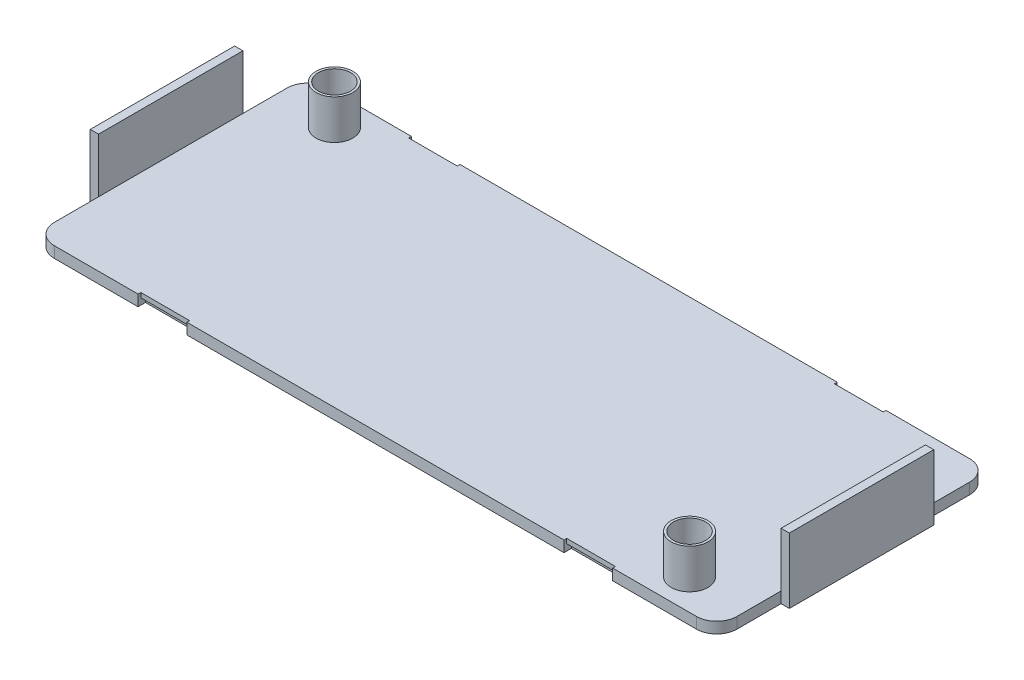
ISO-10303-21;
HEADER;
FILE_DESCRIPTION(('STEP AP214'),'2;1');
FILE_NAME('part.step','',(''),(''),'','','');
FILE_SCHEMA(('AUTOMOTIVE_DESIGN { 1 0 10303 214 1 1 1 1 }'));
ENDSEC;
DATA;
#1=APPLICATION_CONTEXT('core data for automotive mechanical design processes');
#2=APPLICATION_PROTOCOL_DEFINITION('international standard','automotive_design',2000,#1);
#3=PRODUCT_CONTEXT('',#1,'mechanical');
#4=PRODUCT('Part','Part','',(#3));
#5=PRODUCT_RELATED_PRODUCT_CATEGORY('part','',(#4));
#6=PRODUCT_DEFINITION_FORMATION('','',#4);
#7=PRODUCT_DEFINITION_CONTEXT('part definition',#1,'design');
#8=PRODUCT_DEFINITION('design','',#6,#7);
#9=PRODUCT_DEFINITION_SHAPE('','',#8);
#10=(LENGTH_UNIT() NAMED_UNIT(*) SI_UNIT(.MILLI.,.METRE.));
#11=(NAMED_UNIT(*) PLANE_ANGLE_UNIT() SI_UNIT($,.RADIAN.));
#12=(NAMED_UNIT(*) SI_UNIT($,.STERADIAN.) SOLID_ANGLE_UNIT());
#13=UNCERTAINTY_MEASURE_WITH_UNIT(LENGTH_MEASURE(1.E-05),#10,'distance_accuracy_value','');
#14=(GEOMETRIC_REPRESENTATION_CONTEXT(3) GLOBAL_UNCERTAINTY_ASSIGNED_CONTEXT((#13)) GLOBAL_UNIT_ASSIGNED_CONTEXT((#10,
#11,#12)) REPRESENTATION_CONTEXT('',''));
#15=CARTESIAN_POINT('',(0.,0.,0.));
#16=DIRECTION('',(0.,0.,1.));
#17=DIRECTION('',(1.,0.,0.));
#18=AXIS2_PLACEMENT_3D('',#15,#16,#17);
#19=CARTESIAN_POINT('',(26.4223872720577,5.5,1.80900937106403));
#20=DIRECTION('',(0.,-1.,0.));
#21=DIRECTION('',(0.,0.,-1.));
#22=AXIS2_PLACEMENT_3D('',#19,#20,#21);
#23=CYLINDRICAL_SURFACE('',#22,2.);
#24=CARTESIAN_POINT('',(26.4223872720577,1.2,1.80900937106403));
#25=DIRECTION('',(0.,1.,0.));
#26=DIRECTION('',(0.,0.,1.));
#27=AXIS2_PLACEMENT_3D('',#24,#25,#26);
#28=CIRCLE('',#27,2.);
#29=CARTESIAN_POINT('',(26.4223872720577,1.2,3.80900937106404));
#30=VERTEX_POINT('',#29);
#31=EDGE_CURVE('E11',#30,#30,#28,.T.);
#32=ORIENTED_EDGE('',*,*,#31,.T.);
#33=EDGE_LOOP('',(#32));
#34=FACE_BOUND('',#33,.T.);
#35=CARTESIAN_POINT('',(26.4223872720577,5.5,1.80900937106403));
#36=DIRECTION('',(0.,1.,0.));
#37=DIRECTION('',(0.,0.,1.));
#38=AXIS2_PLACEMENT_3D('',#35,#36,#37);
#39=CIRCLE('',#38,2.);
#40=CARTESIAN_POINT('',(26.4223872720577,5.5,3.80900937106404));
#41=VERTEX_POINT('',#40);
#42=EDGE_CURVE('E733',#41,#41,#39,.T.);
#43=ORIENTED_EDGE('',*,*,#42,.F.);
#44=EDGE_LOOP('',(#43));
#45=FACE_BOUND('',#44,.T.);
#46=ADVANCED_FACE('F17',(#34,#45),#23,.T.);
#47=CARTESIAN_POINT('',(-35.1776127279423,5.5,-21.190990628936));
#48=DIRECTION('',(0.,-1.,0.));
#49=DIRECTION('',(0.,0.,-1.));
#50=AXIS2_PLACEMENT_3D('',#47,#48,#49);
#51=CYLINDRICAL_SURFACE('',#50,2.);
#52=CARTESIAN_POINT('',(-35.1776127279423,1.2,-21.190990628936));
#53=DIRECTION('',(0.,1.,0.));
#54=DIRECTION('',(0.,0.,1.));
#55=AXIS2_PLACEMENT_3D('',#52,#53,#54);
#56=CIRCLE('',#55,2.);
#57=CARTESIAN_POINT('',(-35.1776127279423,1.2,-19.190990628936));
#58=VERTEX_POINT('',#57);
#59=EDGE_CURVE('E27',#58,#58,#56,.T.);
#60=ORIENTED_EDGE('',*,*,#59,.T.);
#61=EDGE_LOOP('',(#60));
#62=FACE_BOUND('',#61,.T.);
#63=CARTESIAN_POINT('',(-35.1776127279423,5.5,-21.190990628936));
#64=DIRECTION('',(0.,1.,0.));
#65=DIRECTION('',(0.,0.,1.));
#66=AXIS2_PLACEMENT_3D('',#63,#64,#65);
#67=CIRCLE('',#66,2.);
#68=CARTESIAN_POINT('',(-35.1776127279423,5.5,-19.190990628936));
#69=VERTEX_POINT('',#68);
#70=EDGE_CURVE('E731',#69,#69,#67,.T.);
#71=ORIENTED_EDGE('',*,*,#70,.F.);
#72=EDGE_LOOP('',(#71));
#73=FACE_BOUND('',#72,.T.);
#74=ADVANCED_FACE('F755',(#62,#73),#51,.T.);
#75=CARTESIAN_POINT('',(26.4223872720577,1.2,1.80900937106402));
#76=DIRECTION('',(0.,-1.,0.));
#77=DIRECTION('',(0.,0.,-1.));
#78=AXIS2_PLACEMENT_3D('',#75,#76,#77);
#79=CYLINDRICAL_SURFACE('',#78,1.74999999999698);
#80=CARTESIAN_POINT('',(26.4223872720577,0.,1.80900937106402));
#81=DIRECTION('',(0.,1.,0.));
#82=DIRECTION('',(0.,0.,1.));
#83=AXIS2_PLACEMENT_3D('',#80,#81,#82);
#84=CIRCLE('',#83,1.74999999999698);
#85=CARTESIAN_POINT('',(26.4223872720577,0.,3.559009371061));
#86=VERTEX_POINT('',#85);
#87=EDGE_CURVE('E674',#86,#86,#84,.T.);
#88=ORIENTED_EDGE('',*,*,#87,.F.);
#89=EDGE_LOOP('',(#88));
#90=FACE_BOUND('',#89,.T.);
#91=CARTESIAN_POINT('',(26.4223872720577,5.5,1.80900937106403));
#92=DIRECTION('',(0.,1.,0.));
#93=DIRECTION('',(0.,0.,1.));
#94=AXIS2_PLACEMENT_3D('',#91,#92,#93);
#95=CIRCLE('',#94,1.75000000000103);
#96=CARTESIAN_POINT('',(26.4223872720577,5.5,3.55900937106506));
#97=VERTEX_POINT('',#96);
#98=EDGE_CURVE('E686',#97,#97,#95,.T.);
#99=ORIENTED_EDGE('',*,*,#98,.T.);
#100=EDGE_LOOP('',(#99));
#101=FACE_BOUND('',#100,.T.);
#102=ADVANCED_FACE('F745',(#90,#101),#79,.F.);
#103=CARTESIAN_POINT('',(-35.1776127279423,1.2,-21.190990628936));
#104=DIRECTION('',(0.,-1.,0.));
#105=DIRECTION('',(0.,0.,-1.));
#106=AXIS2_PLACEMENT_3D('',#103,#104,#105);
#107=CYLINDRICAL_SURFACE('',#106,1.75000000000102);
#108=CARTESIAN_POINT('',(-35.1776127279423,0.,-21.190990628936));
#109=DIRECTION('',(0.,1.,0.));
#110=DIRECTION('',(0.,0.,1.));
#111=AXIS2_PLACEMENT_3D('',#108,#109,#110);
#112=CIRCLE('',#111,1.75000000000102);
#113=CARTESIAN_POINT('',(-35.1776127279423,0.,-19.440990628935));
#114=VERTEX_POINT('',#113);
#115=EDGE_CURVE('E627',#114,#114,#112,.T.);
#116=ORIENTED_EDGE('',*,*,#115,.F.);
#117=EDGE_LOOP('',(#116));
#118=FACE_BOUND('',#117,.T.);
#119=CARTESIAN_POINT('',(-35.1776127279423,5.5,-21.190990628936));
#120=DIRECTION('',(0.,1.,0.));
#121=DIRECTION('',(0.,0.,1.));
#122=AXIS2_PLACEMENT_3D('',#119,#120,#121);
#123=CIRCLE('',#122,1.75000000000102);
#124=CARTESIAN_POINT('',(-35.1776127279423,5.5,-19.440990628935));
#125=VERTEX_POINT('',#124);
#126=EDGE_CURVE('E688',#125,#125,#123,.T.);
#127=ORIENTED_EDGE('',*,*,#126,.T.);
#128=EDGE_LOOP('',(#127));
#129=FACE_BOUND('',#128,.T.);
#130=ADVANCED_FACE('F766',(#118,#129),#107,.F.);
#131=CARTESIAN_POINT('',(30.5223872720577,1.2,2.959009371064));
#132=DIRECTION('',(0.,1.,0.));
#133=DIRECTION('',(0.,0.,1.));
#134=AXIS2_PLACEMENT_3D('',#131,#132,#133);
#135=PLANE('',#134);
#136=ORIENTED_EDGE('',*,*,#59,.F.);
#137=EDGE_LOOP('',(#136));
#138=FACE_BOUND('',#137,.T.);
#139=DIRECTION('',(0.,0.,-1.));
#140=VECTOR('',#139,1.);
#141=CARTESIAN_POINT('',(32.7223872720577,1.2,-1.84099062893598));
#142=LINE('',#141,#140);
#143=CARTESIAN_POINT('',(32.7223872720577,1.2,2.959009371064));
#144=VERTEX_POINT('',#143);
#145=CARTESIAN_POINT('',(32.7223872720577,1.2,-1.84099062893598));
#146=VERTEX_POINT('',#145);
#147=EDGE_CURVE('E690',#144,#146,#142,.T.);
#148=ORIENTED_EDGE('',*,*,#147,.T.);
#149=DIRECTION('',(0.,0.,-1.));
#150=VECTOR('',#149,1.);
#151=CARTESIAN_POINT('',(32.7223872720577,1.2,2.959009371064));
#152=LINE('',#151,#150);
#153=CARTESIAN_POINT('',(32.7223872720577,1.2,-17.540990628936));
#154=VERTEX_POINT('',#153);
#155=EDGE_CURVE('E693',#146,#154,#152,.T.);
#156=ORIENTED_EDGE('',*,*,#155,.T.);
#157=DIRECTION('',(0.,0.,-1.));
#158=VECTOR('',#157,1.);
#159=CARTESIAN_POINT('',(32.7223872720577,1.2,-22.340990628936));
#160=LINE('',#159,#158);
#161=CARTESIAN_POINT('',(32.7223872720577,1.2,-22.340990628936));
#162=VERTEX_POINT('',#161);
#163=EDGE_CURVE('E696',#154,#162,#160,.T.);
#164=ORIENTED_EDGE('',*,*,#163,.T.);
#165=CARTESIAN_POINT('',(30.5223872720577,1.2,-22.340990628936));
#166=DIRECTION('',(0.,1.,0.));
#167=DIRECTION('',(0.,0.,1.));
#168=AXIS2_PLACEMENT_3D('',#165,#166,#167);
#169=CIRCLE('',#168,2.20000000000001);
#170=CARTESIAN_POINT('',(30.5223872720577,1.2,-24.540990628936));
#171=VERTEX_POINT('',#170);
#172=EDGE_CURVE('E699',#162,#171,#169,.T.);
#173=ORIENTED_EDGE('',*,*,#172,.T.);
#174=DIRECTION('',(-1.,0.,0.));
#175=VECTOR('',#174,1.);
#176=CARTESIAN_POINT('',(21.4223872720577,1.2,-24.540990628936));
#177=LINE('',#176,#175);
#178=CARTESIAN_POINT('',(21.4223872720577,1.2,-24.540990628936));
#179=VERTEX_POINT('',#178);
#180=EDGE_CURVE('E539',#171,#179,#177,.T.);
#181=ORIENTED_EDGE('',*,*,#180,.T.);
#182=DIRECTION('',(0.,0.,1.));
#183=VECTOR('',#182,1.);
#184=CARTESIAN_POINT('',(21.4223872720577,1.2,-24.540990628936));
#185=LINE('',#184,#183);
#186=CARTESIAN_POINT('',(21.4223872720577,1.2,-24.240990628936));
#187=VERTEX_POINT('',#186);
#188=EDGE_CURVE('E532',#179,#187,#185,.T.);
#189=ORIENTED_EDGE('',*,*,#188,.T.);
#190=DIRECTION('',(-1.,0.,0.));
#191=VECTOR('',#190,1.);
#192=CARTESIAN_POINT('',(16.1223872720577,1.2,-24.240990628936));
#193=LINE('',#192,#191);
#194=CARTESIAN_POINT('',(16.1223872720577,1.2,-24.240990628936));
#195=VERTEX_POINT('',#194);
#196=EDGE_CURVE('E528',#187,#195,#193,.T.);
#197=ORIENTED_EDGE('',*,*,#196,.T.);
#198=DIRECTION('',(0.,0.,-1.));
#199=VECTOR('',#198,1.);
#200=CARTESIAN_POINT('',(16.1223872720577,1.2,-24.540990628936));
#201=LINE('',#200,#199);
#202=CARTESIAN_POINT('',(16.1223872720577,1.2,-24.540990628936));
#203=VERTEX_POINT('',#202);
#204=EDGE_CURVE('E525',#195,#203,#201,.T.);
#205=ORIENTED_EDGE('',*,*,#204,.T.);
#206=DIRECTION('',(-1.,0.,0.));
#207=VECTOR('',#206,1.);
#208=CARTESIAN_POINT('',(16.1223872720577,1.2,-24.540990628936));
#209=LINE('',#208,#207);
#210=CARTESIAN_POINT('',(-24.8776127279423,1.2,-24.540990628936));
#211=VERTEX_POINT('',#210);
#212=EDGE_CURVE('E557',#203,#211,#209,.T.);
#213=ORIENTED_EDGE('',*,*,#212,.T.);
#214=DIRECTION('',(0.,0.,1.));
#215=VECTOR('',#214,1.);
#216=CARTESIAN_POINT('',(-24.8776127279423,1.2,-24.540990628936));
#217=LINE('',#216,#215);
#218=CARTESIAN_POINT('',(-24.8776127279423,1.2,-24.240990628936));
#219=VERTEX_POINT('',#218);
#220=EDGE_CURVE('E559',#211,#219,#217,.T.);
#221=ORIENTED_EDGE('',*,*,#220,.T.);
#222=DIRECTION('',(-1.,0.,0.));
#223=VECTOR('',#222,1.);
#224=CARTESIAN_POINT('',(-24.8776127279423,1.2,-24.240990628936));
#225=LINE('',#224,#223);
#226=CARTESIAN_POINT('',(-30.1776127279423,1.2,-24.240990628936));
#227=VERTEX_POINT('',#226);
#228=EDGE_CURVE('E564',#219,#227,#225,.T.);
#229=ORIENTED_EDGE('',*,*,#228,.T.);
#230=DIRECTION('',(0.,0.,-1.));
#231=VECTOR('',#230,1.);
#232=CARTESIAN_POINT('',(-30.1776127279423,1.2,-24.540990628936));
#233=LINE('',#232,#231);
#234=CARTESIAN_POINT('',(-30.1776127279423,1.2,-24.540990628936));
#235=VERTEX_POINT('',#234);
#236=EDGE_CURVE('E567',#227,#235,#233,.T.);
#237=ORIENTED_EDGE('',*,*,#236,.T.);
#238=DIRECTION('',(-1.,0.,0.));
#239=VECTOR('',#238,1.);
#240=CARTESIAN_POINT('',(-30.1776127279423,1.2,-24.540990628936));
#241=LINE('',#240,#239);
#242=CARTESIAN_POINT('',(-39.2776127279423,1.2,-24.540990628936));
#243=VERTEX_POINT('',#242);
#244=EDGE_CURVE('E570',#235,#243,#241,.T.);
#245=ORIENTED_EDGE('',*,*,#244,.T.);
#246=CARTESIAN_POINT('',(-39.2776127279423,1.2,-22.340990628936));
#247=DIRECTION('',(0.,1.,0.));
#248=DIRECTION('',(0.,0.,1.));
#249=AXIS2_PLACEMENT_3D('',#246,#247,#248);
#250=CIRCLE('',#249,2.20000000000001);
#251=CARTESIAN_POINT('',(-41.4776127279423,1.2,-22.340990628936));
#252=VERTEX_POINT('',#251);
#253=EDGE_CURVE('E573',#243,#252,#250,.T.);
#254=ORIENTED_EDGE('',*,*,#253,.T.);
#255=DIRECTION('',(0.,0.,1.));
#256=VECTOR('',#255,1.);
#257=CARTESIAN_POINT('',(-41.4776127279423,1.2,-22.340990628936));
#258=LINE('',#257,#256);
#259=CARTESIAN_POINT('',(-41.4776127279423,1.2,-17.540990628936));
#260=VERTEX_POINT('',#259);
#261=EDGE_CURVE('E576',#252,#260,#258,.T.);
#262=ORIENTED_EDGE('',*,*,#261,.T.);
#263=DIRECTION('',(0.,0.,1.));
#264=VECTOR('',#263,1.);
#265=CARTESIAN_POINT('',(-41.4776127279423,1.2,2.959009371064));
#266=LINE('',#265,#264);
#267=CARTESIAN_POINT('',(-41.4776127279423,1.2,-1.84099062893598));
#268=VERTEX_POINT('',#267);
#269=EDGE_CURVE('E579',#260,#268,#266,.T.);
#270=ORIENTED_EDGE('',*,*,#269,.T.);
#271=DIRECTION('',(0.,0.,1.));
#272=VECTOR('',#271,1.);
#273=CARTESIAN_POINT('',(-41.4776127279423,1.2,-1.84099062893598));
#274=LINE('',#273,#272);
#275=CARTESIAN_POINT('',(-41.4776127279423,1.2,2.95900937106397));
#276=VERTEX_POINT('',#275);
#277=EDGE_CURVE('E582',#268,#276,#274,.T.);
#278=ORIENTED_EDGE('',*,*,#277,.T.);
#279=CARTESIAN_POINT('',(-39.2776127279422,1.2,2.95900937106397));
#280=DIRECTION('',(0.,1.,0.));
#281=DIRECTION('',(0.,0.,1.));
#282=AXIS2_PLACEMENT_3D('',#279,#280,#281);
#283=CIRCLE('',#282,2.20000000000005);
#284=CARTESIAN_POINT('',(-39.2776127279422,1.2,5.15900937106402));
#285=VERTEX_POINT('',#284);
#286=EDGE_CURVE('E585',#276,#285,#283,.T.);
#287=ORIENTED_EDGE('',*,*,#286,.T.);
#288=DIRECTION('',(1.,0.,0.));
#289=VECTOR('',#288,1.);
#290=CARTESIAN_POINT('',(-30.1776127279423,1.2,5.15900937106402));
#291=LINE('',#290,#289);
#292=CARTESIAN_POINT('',(-30.1776127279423,1.2,5.15900937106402));
#293=VERTEX_POINT('',#292);
#294=EDGE_CURVE('E588',#285,#293,#291,.T.);
#295=ORIENTED_EDGE('',*,*,#294,.T.);
#296=DIRECTION('',(0.,0.,-1.));
#297=VECTOR('',#296,1.);
#298=CARTESIAN_POINT('',(-30.1776127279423,1.2,5.15900937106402));
#299=LINE('',#298,#297);
#300=CARTESIAN_POINT('',(-30.1776127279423,1.2,4.85900937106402));
#301=VERTEX_POINT('',#300);
#302=EDGE_CURVE('E591',#293,#301,#299,.T.);
#303=ORIENTED_EDGE('',*,*,#302,.T.);
#304=DIRECTION('',(1.,0.,0.));
#305=VECTOR('',#304,1.);
#306=CARTESIAN_POINT('',(-24.8776127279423,1.2,4.85900937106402));
#307=LINE('',#306,#305);
#308=CARTESIAN_POINT('',(-24.8776127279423,1.2,4.85900937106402));
#309=VERTEX_POINT('',#308);
#310=EDGE_CURVE('E594',#301,#309,#307,.T.);
#311=ORIENTED_EDGE('',*,*,#310,.T.);
#312=DIRECTION('',(0.,0.,1.));
#313=VECTOR('',#312,1.);
#314=CARTESIAN_POINT('',(-24.8776127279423,1.2,5.15900937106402));
#315=LINE('',#314,#313);
#316=CARTESIAN_POINT('',(-24.8776127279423,1.2,5.15900937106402));
#317=VERTEX_POINT('',#316);
#318=EDGE_CURVE('E597',#309,#317,#315,.T.);
#319=ORIENTED_EDGE('',*,*,#318,.T.);
#320=DIRECTION('',(1.,0.,0.));
#321=VECTOR('',#320,1.);
#322=CARTESIAN_POINT('',(16.1223872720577,1.2,5.15900937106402));
#323=LINE('',#322,#321);
#324=CARTESIAN_POINT('',(16.1223872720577,1.2,5.15900937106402));
#325=VERTEX_POINT('',#324);
#326=EDGE_CURVE('E600',#317,#325,#323,.T.);
#327=ORIENTED_EDGE('',*,*,#326,.T.);
#328=DIRECTION('',(0.,0.,-1.));
#329=VECTOR('',#328,1.);
#330=CARTESIAN_POINT('',(16.1223872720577,1.2,5.15900937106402));
#331=LINE('',#330,#329);
#332=CARTESIAN_POINT('',(16.1223872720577,1.2,4.85900937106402));
#333=VERTEX_POINT('',#332);
#334=EDGE_CURVE('E603',#325,#333,#331,.T.);
#335=ORIENTED_EDGE('',*,*,#334,.T.);
#336=DIRECTION('',(1.,0.,0.));
#337=VECTOR('',#336,1.);
#338=CARTESIAN_POINT('',(16.1223872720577,1.2,4.85900937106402));
#339=LINE('',#338,#337);
#340=CARTESIAN_POINT('',(21.4223872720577,1.2,4.85900937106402));
#341=VERTEX_POINT('',#340);
#342=EDGE_CURVE('E606',#333,#341,#339,.T.);
#343=ORIENTED_EDGE('',*,*,#342,.T.);
#344=DIRECTION('',(0.,0.,1.));
#345=VECTOR('',#344,1.);
#346=CARTESIAN_POINT('',(21.4223872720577,1.2,5.15900937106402));
#347=LINE('',#346,#345);
#348=CARTESIAN_POINT('',(21.4223872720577,1.2,5.15900937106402));
#349=VERTEX_POINT('',#348);
#350=EDGE_CURVE('E609',#341,#349,#347,.T.);
#351=ORIENTED_EDGE('',*,*,#350,.T.);
#352=DIRECTION('',(1.,0.,0.));
#353=VECTOR('',#352,1.);
#354=CARTESIAN_POINT('',(21.4223872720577,1.2,5.15900937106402));
#355=LINE('',#354,#353);
#356=CARTESIAN_POINT('',(30.5223872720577,1.2,5.15900937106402));
#357=VERTEX_POINT('',#356);
#358=EDGE_CURVE('E612',#349,#357,#355,.T.);
#359=ORIENTED_EDGE('',*,*,#358,.T.);
#360=CARTESIAN_POINT('',(30.5223872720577,1.2,2.959009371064));
#361=DIRECTION('',(0.,1.,0.));
#362=DIRECTION('',(0.,0.,1.));
#363=AXIS2_PLACEMENT_3D('',#360,#361,#362);
#364=CIRCLE('',#363,2.20000000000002);
#365=EDGE_CURVE('E615',#357,#144,#364,.T.);
#366=ORIENTED_EDGE('',*,*,#365,.T.);
#367=EDGE_LOOP('',(#148,#156,#164,#173,#181,#189,#197,#205,#213,#221,#229,#237,#245,#254,#262,
#270,#278,#287,#295,#303,#311,#319,#327,#335,#343,#351,#359,#366));
#368=FACE_BOUND('',#367,.T.);
#369=ORIENTED_EDGE('',*,*,#31,.F.);
#370=EDGE_LOOP('',(#369));
#371=FACE_BOUND('',#370,.T.);
#372=ADVANCED_FACE('F536',(#138,#368,#371),#135,.T.);
#373=CARTESIAN_POINT('',(16.1223872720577,1.2,4.85900937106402));
#374=DIRECTION('',(0.,0.,-1.));
#375=DIRECTION('',(-1.,0.,0.));
#376=AXIS2_PLACEMENT_3D('',#373,#374,#375);
#377=PLANE('',#376);
#378=DIRECTION('',(-1.,0.,0.));
#379=VECTOR('',#378,1.);
#380=CARTESIAN_POINT('',(16.1223872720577,0.7,4.85900937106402));
#381=LINE('',#380,#379);
#382=CARTESIAN_POINT('',(21.4223872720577,0.7,4.85900937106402));
#383=VERTEX_POINT('',#382);
#384=CARTESIAN_POINT('',(16.1223872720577,0.7,4.85900937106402));
#385=VERTEX_POINT('',#384);
#386=EDGE_CURVE('E311',#383,#385,#381,.T.);
#387=ORIENTED_EDGE('',*,*,#386,.F.);
#388=DIRECTION('',(0.,-1.,0.));
#389=VECTOR('',#388,1.);
#390=CARTESIAN_POINT('',(21.4223872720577,1.2,4.85900937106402));
#391=LINE('',#390,#389);
#392=EDGE_CURVE('E298',#341,#383,#391,.T.);
#393=ORIENTED_EDGE('',*,*,#392,.F.);
#394=ORIENTED_EDGE('',*,*,#342,.F.);
#395=DIRECTION('',(0.,-1.,0.));
#396=VECTOR('',#395,1.);
#397=CARTESIAN_POINT('',(16.1223872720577,1.2,4.85900937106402));
#398=LINE('',#397,#396);
#399=EDGE_CURVE('E617',#333,#385,#398,.T.);
#400=ORIENTED_EDGE('',*,*,#399,.T.);
#401=EDGE_LOOP('',(#387,#393,#394,#400));
#402=FACE_BOUND('',#401,.T.);
#403=ADVANCED_FACE('F773',(#402),#377,.F.);
#404=CARTESIAN_POINT('',(-24.8776127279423,1.2,4.85900937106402));
#405=DIRECTION('',(0.,0.,-1.));
#406=DIRECTION('',(-1.,0.,0.));
#407=AXIS2_PLACEMENT_3D('',#404,#405,#406);
#408=PLANE('',#407);
#409=DIRECTION('',(-1.,0.,0.));
#410=VECTOR('',#409,1.);
#411=CARTESIAN_POINT('',(-24.8776127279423,0.7,4.85900937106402));
#412=LINE('',#411,#410);
#413=CARTESIAN_POINT('',(-24.8776127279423,0.7,4.85900937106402));
#414=VERTEX_POINT('',#413);
#415=CARTESIAN_POINT('',(-30.1776127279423,0.7,4.85900937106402));
#416=VERTEX_POINT('',#415);
#417=EDGE_CURVE('E446',#414,#416,#412,.T.);
#418=ORIENTED_EDGE('',*,*,#417,.F.);
#419=DIRECTION('',(0.,-1.,0.));
#420=VECTOR('',#419,1.);
#421=CARTESIAN_POINT('',(-24.8776127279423,1.2,4.85900937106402));
#422=LINE('',#421,#420);
#423=EDGE_CURVE('E456',#309,#414,#422,.T.);
#424=ORIENTED_EDGE('',*,*,#423,.F.);
#425=ORIENTED_EDGE('',*,*,#310,.F.);
#426=DIRECTION('',(0.,-1.,0.));
#427=VECTOR('',#426,1.);
#428=CARTESIAN_POINT('',(-30.1776127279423,1.2,4.85900937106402));
#429=LINE('',#428,#427);
#430=EDGE_CURVE('E621',#301,#416,#429,.T.);
#431=ORIENTED_EDGE('',*,*,#430,.T.);
#432=EDGE_LOOP('',(#418,#424,#425,#431));
#433=FACE_BOUND('',#432,.T.);
#434=ADVANCED_FACE('F777',(#433),#408,.F.);
#435=CARTESIAN_POINT('',(30.5223872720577,0.,2.959009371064));
#436=DIRECTION('',(0.,1.,0.));
#437=DIRECTION('',(0.,0.,1.));
#438=AXIS2_PLACEMENT_3D('',#435,#436,#437);
#439=PLANE('',#438);
#440=DIRECTION('',(1.,0.,0.));
#441=VECTOR('',#440,1.);
#442=CARTESIAN_POINT('',(16.1223872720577,0.,4.35900937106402));
#443=LINE('',#442,#441);
#444=CARTESIAN_POINT('',(16.1223872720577,0.,4.35900937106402));
#445=VERTEX_POINT('',#444);
#446=CARTESIAN_POINT('',(21.4223872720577,0.,4.35900937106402));
#447=VERTEX_POINT('',#446);
#448=EDGE_CURVE('E301',#445,#447,#443,.T.);
#449=ORIENTED_EDGE('',*,*,#448,.F.);
#450=DIRECTION('',(0.,0.,-1.));
#451=VECTOR('',#450,1.);
#452=CARTESIAN_POINT('',(16.1223872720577,0.,5.15900937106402));
#453=LINE('',#452,#451);
#454=CARTESIAN_POINT('',(16.1223872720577,0.,5.15900937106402));
#455=VERTEX_POINT('',#454);
#456=EDGE_CURVE('E451',#455,#445,#453,.T.);
#457=ORIENTED_EDGE('',*,*,#456,.F.);
#458=DIRECTION('',(1.,0.,0.));
#459=VECTOR('',#458,1.);
#460=CARTESIAN_POINT('',(16.1223872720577,0.,5.15900937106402));
#461=LINE('',#460,#459);
#462=CARTESIAN_POINT('',(-24.8776127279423,0.,5.15900937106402));
#463=VERTEX_POINT('',#462);
#464=EDGE_CURVE('E450',#463,#455,#461,.T.);
#465=ORIENTED_EDGE('',*,*,#464,.F.);
#466=DIRECTION('',(0.,0.,1.));
#467=VECTOR('',#466,1.);
#468=CARTESIAN_POINT('',(-24.8776127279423,0.,5.15900937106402));
#469=LINE('',#468,#467);
#470=CARTESIAN_POINT('',(-24.8776127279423,0.,4.35900937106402));
#471=VERTEX_POINT('',#470);
#472=EDGE_CURVE('E440',#471,#463,#469,.T.);
#473=ORIENTED_EDGE('',*,*,#472,.F.);
#474=DIRECTION('',(1.,0.,0.));
#475=VECTOR('',#474,1.);
#476=CARTESIAN_POINT('',(-30.1776127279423,0.,4.35900937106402));
#477=LINE('',#476,#475);
#478=CARTESIAN_POINT('',(-30.1776127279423,0.,4.35900937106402));
#479=VERTEX_POINT('',#478);
#480=EDGE_CURVE('E443',#479,#471,#477,.T.);
#481=ORIENTED_EDGE('',*,*,#480,.F.);
#482=DIRECTION('',(0.,0.,-1.));
#483=VECTOR('',#482,1.);
#484=CARTESIAN_POINT('',(-30.1776127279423,0.,5.15900937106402));
#485=LINE('',#484,#483);
#486=CARTESIAN_POINT('',(-30.1776127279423,0.,5.15900937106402));
#487=VERTEX_POINT('',#486);
#488=EDGE_CURVE('E436',#487,#479,#485,.T.);
#489=ORIENTED_EDGE('',*,*,#488,.F.);
#490=DIRECTION('',(1.,0.,0.));
#491=VECTOR('',#490,1.);
#492=CARTESIAN_POINT('',(-30.1776127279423,0.,5.15900937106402));
#493=LINE('',#492,#491);
#494=CARTESIAN_POINT('',(-39.2776127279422,0.,5.15900937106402));
#495=VERTEX_POINT('',#494);
#496=EDGE_CURVE('E432',#495,#487,#493,.T.);
#497=ORIENTED_EDGE('',*,*,#496,.F.);
#498=CARTESIAN_POINT('',(-39.2776127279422,0.,2.95900937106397));
#499=DIRECTION('',(0.,1.,0.));
#500=DIRECTION('',(0.,0.,1.));
#501=AXIS2_PLACEMENT_3D('',#498,#499,#500);
#502=CIRCLE('',#501,2.20000000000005);
#503=CARTESIAN_POINT('',(-41.4776127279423,0.,2.95900937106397));
#504=VERTEX_POINT('',#503);
#505=EDGE_CURVE('E425',#504,#495,#502,.T.);
#506=ORIENTED_EDGE('',*,*,#505,.F.);
#507=DIRECTION('',(0.,0.,1.));
#508=VECTOR('',#507,1.);
#509=CARTESIAN_POINT('',(-41.4776127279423,0.,-1.84099062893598));
#510=LINE('',#509,#508);
#511=CARTESIAN_POINT('',(-41.4776127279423,0.,-1.84099062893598));
#512=VERTEX_POINT('',#511);
#513=EDGE_CURVE('E419',#512,#504,#510,.T.);
#514=ORIENTED_EDGE('',*,*,#513,.F.);
#515=DIRECTION('',(1.,0.,0.));
#516=VECTOR('',#515,1.);
#517=CARTESIAN_POINT('',(-42.3776127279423,0.,-1.84099062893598));
#518=LINE('',#517,#516);
#519=CARTESIAN_POINT('',(-42.3776127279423,0.,-1.84099062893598));
#520=VERTEX_POINT('',#519);
#521=EDGE_CURVE('E412',#520,#512,#518,.T.);
#522=ORIENTED_EDGE('',*,*,#521,.F.);
#523=DIRECTION('',(0.,0.,1.));
#524=VECTOR('',#523,1.);
#525=CARTESIAN_POINT('',(-42.3776127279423,0.,-17.540990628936));
#526=LINE('',#525,#524);
#527=CARTESIAN_POINT('',(-42.3776127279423,0.,-17.540990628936));
#528=VERTEX_POINT('',#527);
#529=EDGE_CURVE('E408',#528,#520,#526,.T.);
#530=ORIENTED_EDGE('',*,*,#529,.F.);
#531=DIRECTION('',(-1.,0.,0.));
#532=VECTOR('',#531,1.);
#533=CARTESIAN_POINT('',(-42.3776127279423,0.,-17.540990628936));
#534=LINE('',#533,#532);
#535=CARTESIAN_POINT('',(-41.4776127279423,0.,-17.540990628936));
#536=VERTEX_POINT('',#535);
#537=EDGE_CURVE('E403',#536,#528,#534,.T.);
#538=ORIENTED_EDGE('',*,*,#537,.F.);
#539=DIRECTION('',(0.,0.,1.));
#540=VECTOR('',#539,1.);
#541=CARTESIAN_POINT('',(-41.4776127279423,0.,-22.340990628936));
#542=LINE('',#541,#540);
#543=CARTESIAN_POINT('',(-41.4776127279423,0.,-22.340990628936));
#544=VERTEX_POINT('',#543);
#545=EDGE_CURVE('E399',#544,#536,#542,.T.);
#546=ORIENTED_EDGE('',*,*,#545,.F.);
#547=CARTESIAN_POINT('',(-39.2776127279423,0.,-22.340990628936));
#548=DIRECTION('',(0.,1.,0.));
#549=DIRECTION('',(0.,0.,1.));
#550=AXIS2_PLACEMENT_3D('',#547,#548,#549);
#551=CIRCLE('',#550,2.20000000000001);
#552=CARTESIAN_POINT('',(-39.2776127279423,0.,-24.540990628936));
#553=VERTEX_POINT('',#552);
#554=EDGE_CURVE('E395',#553,#544,#551,.T.);
#555=ORIENTED_EDGE('',*,*,#554,.F.);
#556=DIRECTION('',(-1.,0.,0.));
#557=VECTOR('',#556,1.);
#558=CARTESIAN_POINT('',(-30.1776127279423,0.,-24.540990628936));
#559=LINE('',#558,#557);
#560=CARTESIAN_POINT('',(-30.1776127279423,0.,-24.540990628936));
#561=VERTEX_POINT('',#560);
#562=EDGE_CURVE('E394',#561,#553,#559,.T.);
#563=ORIENTED_EDGE('',*,*,#562,.F.);
#564=DIRECTION('',(0.,0.,-1.));
#565=VECTOR('',#564,1.);
#566=CARTESIAN_POINT('',(-30.1776127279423,0.,-24.540990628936));
#567=LINE('',#566,#565);
#568=CARTESIAN_POINT('',(-30.1776127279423,0.,-23.740990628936));
#569=VERTEX_POINT('',#568);
#570=EDGE_CURVE('E390',#569,#561,#567,.T.);
#571=ORIENTED_EDGE('',*,*,#570,.F.);
#572=DIRECTION('',(-1.,0.,0.));
#573=VECTOR('',#572,1.);
#574=CARTESIAN_POINT('',(-30.1776127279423,0.,-23.740990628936));
#575=LINE('',#574,#573);
#576=CARTESIAN_POINT('',(-24.8776127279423,0.,-23.740990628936));
#577=VERTEX_POINT('',#576);
#578=EDGE_CURVE('E373',#577,#569,#575,.T.);
#579=ORIENTED_EDGE('',*,*,#578,.F.);
#580=DIRECTION('',(0.,0.,1.));
#581=VECTOR('',#580,1.);
#582=CARTESIAN_POINT('',(-24.8776127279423,0.,-24.540990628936));
#583=LINE('',#582,#581);
#584=CARTESIAN_POINT('',(-24.8776127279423,0.,-24.540990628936));
#585=VERTEX_POINT('',#584);
#586=EDGE_CURVE('E370',#585,#577,#583,.T.);
#587=ORIENTED_EDGE('',*,*,#586,.F.);
#588=DIRECTION('',(-1.,0.,0.));
#589=VECTOR('',#588,1.);
#590=CARTESIAN_POINT('',(16.1223872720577,0.,-24.540990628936));
#591=LINE('',#590,#589);
#592=CARTESIAN_POINT('',(16.1223872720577,0.,-24.540990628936));
#593=VERTEX_POINT('',#592);
#594=EDGE_CURVE('E366',#593,#585,#591,.T.);
#595=ORIENTED_EDGE('',*,*,#594,.F.);
#596=DIRECTION('',(0.,0.,-1.));
#597=VECTOR('',#596,1.);
#598=CARTESIAN_POINT('',(16.1223872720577,0.,-24.540990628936));
#599=LINE('',#598,#597);
#600=CARTESIAN_POINT('',(16.1223872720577,0.,-23.740990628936));
#601=VERTEX_POINT('',#600);
#602=EDGE_CURVE('E362',#601,#593,#599,.T.);
#603=ORIENTED_EDGE('',*,*,#602,.F.);
#604=DIRECTION('',(-1.,0.,0.));
#605=VECTOR('',#604,1.);
#606=CARTESIAN_POINT('',(16.1223872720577,0.,-23.740990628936));
#607=LINE('',#606,#605);
#608=CARTESIAN_POINT('',(21.4223872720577,0.,-23.740990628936));
#609=VERTEX_POINT('',#608);
#610=EDGE_CURVE('E351',#609,#601,#607,.T.);
#611=ORIENTED_EDGE('',*,*,#610,.F.);
#612=DIRECTION('',(0.,0.,1.));
#613=VECTOR('',#612,1.);
#614=CARTESIAN_POINT('',(21.4223872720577,0.,-24.540990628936));
#615=LINE('',#614,#613);
#616=CARTESIAN_POINT('',(21.4223872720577,0.,-24.540990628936));
#617=VERTEX_POINT('',#616);
#618=EDGE_CURVE('E511',#617,#609,#615,.T.);
#619=ORIENTED_EDGE('',*,*,#618,.F.);
#620=DIRECTION('',(-1.,0.,0.));
#621=VECTOR('',#620,1.);
#622=CARTESIAN_POINT('',(21.4223872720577,0.,-24.540990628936));
#623=LINE('',#622,#621);
#624=CARTESIAN_POINT('',(30.5223872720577,0.,-24.540990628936));
#625=VERTEX_POINT('',#624);
#626=EDGE_CURVE('E504',#625,#617,#623,.T.);
#627=ORIENTED_EDGE('',*,*,#626,.F.);
#628=CARTESIAN_POINT('',(30.5223872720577,0.,-22.340990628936));
#629=DIRECTION('',(0.,1.,0.));
#630=DIRECTION('',(0.,0.,1.));
#631=AXIS2_PLACEMENT_3D('',#628,#629,#630);
#632=CIRCLE('',#631,2.20000000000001);
#633=CARTESIAN_POINT('',(32.7223872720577,0.,-22.340990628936));
#634=VERTEX_POINT('',#633);
#635=EDGE_CURVE('E497',#634,#625,#632,.T.);
#636=ORIENTED_EDGE('',*,*,#635,.F.);
#637=DIRECTION('',(0.,0.,-1.));
#638=VECTOR('',#637,1.);
#639=CARTESIAN_POINT('',(32.7223872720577,0.,-22.340990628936));
#640=LINE('',#639,#638);
#641=CARTESIAN_POINT('',(32.7223872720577,0.,-17.540990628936));
#642=VERTEX_POINT('',#641);
#643=EDGE_CURVE('E491',#642,#634,#640,.T.);
#644=ORIENTED_EDGE('',*,*,#643,.F.);
#645=DIRECTION('',(-1.,0.,0.));
#646=VECTOR('',#645,1.);
#647=CARTESIAN_POINT('',(32.7223872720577,0.,-17.540990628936));
#648=LINE('',#647,#646);
#649=CARTESIAN_POINT('',(33.6223872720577,0.,-17.540990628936));
#650=VERTEX_POINT('',#649);
#651=EDGE_CURVE('E483',#650,#642,#648,.T.);
#652=ORIENTED_EDGE('',*,*,#651,.F.);
#653=DIRECTION('',(0.,0.,-1.));
#654=VECTOR('',#653,1.);
#655=CARTESIAN_POINT('',(33.6223872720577,0.,-17.540990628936));
#656=LINE('',#655,#654);
#657=CARTESIAN_POINT('',(33.6223872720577,0.,-1.84099062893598));
#658=VERTEX_POINT('',#657);
#659=EDGE_CURVE('E479',#658,#650,#656,.T.);
#660=ORIENTED_EDGE('',*,*,#659,.F.);
#661=DIRECTION('',(1.,0.,0.));
#662=VECTOR('',#661,1.);
#663=CARTESIAN_POINT('',(32.7223872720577,0.,-1.84099062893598));
#664=LINE('',#663,#662);
#665=CARTESIAN_POINT('',(32.7223872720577,0.,-1.84099062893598));
#666=VERTEX_POINT('',#665);
#667=EDGE_CURVE('E472',#666,#658,#664,.T.);
#668=ORIENTED_EDGE('',*,*,#667,.F.);
#669=DIRECTION('',(0.,0.,-1.));
#670=VECTOR('',#669,1.);
#671=CARTESIAN_POINT('',(32.7223872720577,0.,-1.84099062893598));
#672=LINE('',#671,#670);
#673=CARTESIAN_POINT('',(32.7223872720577,0.,2.959009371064));
#674=VERTEX_POINT('',#673);
#675=EDGE_CURVE('E471',#674,#666,#672,.T.);
#676=ORIENTED_EDGE('',*,*,#675,.F.);
#677=CARTESIAN_POINT('',(30.5223872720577,0.,2.959009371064));
#678=DIRECTION('',(0.,1.,0.));
#679=DIRECTION('',(0.,0.,1.));
#680=AXIS2_PLACEMENT_3D('',#677,#678,#679);
#681=CIRCLE('',#680,2.20000000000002);
#682=CARTESIAN_POINT('',(30.5223872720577,0.,5.15900937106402));
#683=VERTEX_POINT('',#682);
#684=EDGE_CURVE('E476',#683,#674,#681,.T.);
#685=ORIENTED_EDGE('',*,*,#684,.F.);
#686=DIRECTION('',(1.,0.,0.));
#687=VECTOR('',#686,1.);
#688=CARTESIAN_POINT('',(21.4223872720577,0.,5.15900937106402));
#689=LINE('',#688,#687);
#690=CARTESIAN_POINT('',(21.4223872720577,0.,5.15900937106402));
#691=VERTEX_POINT('',#690);
#692=EDGE_CURVE('E307',#691,#683,#689,.T.);
#693=ORIENTED_EDGE('',*,*,#692,.F.);
#694=DIRECTION('',(0.,0.,1.));
#695=VECTOR('',#694,1.);
#696=CARTESIAN_POINT('',(21.4223872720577,0.,5.15900937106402));
#697=LINE('',#696,#695);
#698=EDGE_CURVE('E459',#447,#691,#697,.T.);
#699=ORIENTED_EDGE('',*,*,#698,.F.);
#700=EDGE_LOOP('',(#449,#457,#465,#473,#481,#489,#497,#506,#514,#522,#530,#538,#546,#555,#563,
#571,#579,#587,#595,#603,#611,#619,#627,#636,#644,#652,#660,#668,#676,#685,#693,#699));
#701=FACE_BOUND('',#700,.T.);
#702=ORIENTED_EDGE('',*,*,#115,.T.);
#703=EDGE_LOOP('',(#702));
#704=FACE_BOUND('',#703,.T.);
#705=ORIENTED_EDGE('',*,*,#87,.T.);
#706=EDGE_LOOP('',(#705));
#707=FACE_BOUND('',#706,.T.);
#708=ADVANCED_FACE('F708',(#701,#704,#707),#439,.F.);
#709=CARTESIAN_POINT('',(30.5223872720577,1.2,2.959009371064));
#710=DIRECTION('',(0.,-1.,0.));
#711=DIRECTION('',(0.,0.,-1.));
#712=AXIS2_PLACEMENT_3D('',#709,#710,#711);
#713=CYLINDRICAL_SURFACE('',#712,2.20000000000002);
#714=ORIENTED_EDGE('',*,*,#684,.T.);
#715=DIRECTION('',(0.,-1.,0.));
#716=VECTOR('',#715,1.);
#717=CARTESIAN_POINT('',(32.7223872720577,1.2,2.959009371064));
#718=LINE('',#717,#716);
#719=EDGE_CURVE('E468',#144,#674,#718,.T.);
#720=ORIENTED_EDGE('',*,*,#719,.F.);
#721=ORIENTED_EDGE('',*,*,#365,.F.);
#722=DIRECTION('',(0.,-1.,0.));
#723=VECTOR('',#722,1.);
#724=CARTESIAN_POINT('',(30.5223872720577,1.2,5.15900937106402));
#725=LINE('',#724,#723);
#726=EDGE_CURVE('E473',#357,#683,#725,.T.);
#727=ORIENTED_EDGE('',*,*,#726,.T.);
#728=EDGE_LOOP('',(#714,#720,#721,#727));
#729=FACE_BOUND('',#728,.T.);
#730=ADVANCED_FACE('F726',(#729),#713,.T.);
#731=CARTESIAN_POINT('',(32.7223872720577,1.2,-1.84099062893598));
#732=DIRECTION('',(-1.,0.,0.));
#733=DIRECTION('',(0.,0.,1.));
#734=AXIS2_PLACEMENT_3D('',#731,#732,#733);
#735=PLANE('',#734);
#736=ORIENTED_EDGE('',*,*,#675,.T.);
#737=DIRECTION('',(0.,-1.,0.));
#738=VECTOR('',#737,1.);
#739=CARTESIAN_POINT('',(32.7223872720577,1.2,-1.84099062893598));
#740=LINE('',#739,#738);
#741=EDGE_CURVE('E36',#146,#666,#740,.T.);
#742=ORIENTED_EDGE('',*,*,#741,.F.);
#743=ORIENTED_EDGE('',*,*,#147,.F.);
#744=ORIENTED_EDGE('',*,*,#719,.T.);
#745=EDGE_LOOP('',(#736,#742,#743,#744));
#746=FACE_BOUND('',#745,.T.);
#747=ADVANCED_FACE('F725',(#746),#735,.F.);
#748=CARTESIAN_POINT('',(32.7223872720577,1.2,-1.84099062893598));
#749=DIRECTION('',(0.,0.,-1.));
#750=DIRECTION('',(-1.,0.,0.));
#751=AXIS2_PLACEMENT_3D('',#748,#749,#750);
#752=PLANE('',#751);
#753=ORIENTED_EDGE('',*,*,#667,.T.);
#754=DIRECTION('',(0.,-1.,0.));
#755=VECTOR('',#754,1.);
#756=CARTESIAN_POINT('',(33.6223872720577,1.2,-1.84099062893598));
#757=LINE('',#756,#755);
#758=CARTESIAN_POINT('',(33.6223872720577,7.1,-1.84099062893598));
#759=VERTEX_POINT('',#758);
#760=EDGE_CURVE('E480',#759,#658,#757,.T.);
#761=ORIENTED_EDGE('',*,*,#760,.F.);
#762=DIRECTION('',(1.,0.,0.));
#763=VECTOR('',#762,1.);
#764=CARTESIAN_POINT('',(32.7223872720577,7.1,-1.84099062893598));
#765=LINE('',#764,#763);
#766=CARTESIAN_POINT('',(32.7223872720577,7.1,-1.84099062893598));
#767=VERTEX_POINT('',#766);
#768=EDGE_CURVE('E331',#767,#759,#765,.T.);
#769=ORIENTED_EDGE('',*,*,#768,.F.);
#770=DIRECTION('',(0.,-1.,0.));
#771=VECTOR('',#770,1.);
#772=CARTESIAN_POINT('',(32.7223872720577,7.1,-1.84099062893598));
#773=LINE('',#772,#771);
#774=EDGE_CURVE('E478',#767,#146,#773,.T.);
#775=ORIENTED_EDGE('',*,*,#774,.T.);
#776=ORIENTED_EDGE('',*,*,#741,.T.);
#777=EDGE_LOOP('',(#753,#761,#769,#775,#776));
#778=FACE_BOUND('',#777,.T.);
#779=ADVANCED_FACE('F723',(#778),#752,.F.);
#780=CARTESIAN_POINT('',(33.6223872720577,1.2,-17.540990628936));
#781=DIRECTION('',(-1.,0.,0.));
#782=DIRECTION('',(0.,0.,1.));
#783=AXIS2_PLACEMENT_3D('',#780,#781,#782);
#784=PLANE('',#783);
#785=ORIENTED_EDGE('',*,*,#659,.T.);
#786=DIRECTION('',(0.,-1.,0.));
#787=VECTOR('',#786,1.);
#788=CARTESIAN_POINT('',(33.6223872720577,1.2,-17.540990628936));
#789=LINE('',#788,#787);
#790=CARTESIAN_POINT('',(33.6223872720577,7.1,-17.540990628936));
#791=VERTEX_POINT('',#790);
#792=EDGE_CURVE('E488',#791,#650,#789,.T.);
#793=ORIENTED_EDGE('',*,*,#792,.F.);
#794=DIRECTION('',(0.,0.,-1.));
#795=VECTOR('',#794,1.);
#796=CARTESIAN_POINT('',(33.6223872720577,7.1,-1.84099062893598));
#797=LINE('',#796,#795);
#798=EDGE_CURVE('E485',#759,#791,#797,.T.);
#799=ORIENTED_EDGE('',*,*,#798,.F.);
#800=ORIENTED_EDGE('',*,*,#760,.T.);
#801=EDGE_LOOP('',(#785,#793,#799,#800));
#802=FACE_BOUND('',#801,.T.);
#803=ADVANCED_FACE('F719',(#802),#784,.F.);
#804=CARTESIAN_POINT('',(32.7223872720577,1.2,-17.540990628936));
#805=DIRECTION('',(0.,0.,1.));
#806=DIRECTION('',(1.,0.,0.));
#807=AXIS2_PLACEMENT_3D('',#804,#805,#806);
#808=PLANE('',#807);
#809=ORIENTED_EDGE('',*,*,#651,.T.);
#810=DIRECTION('',(0.,-1.,0.));
#811=VECTOR('',#810,1.);
#812=CARTESIAN_POINT('',(32.7223872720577,1.2,-17.540990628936));
#813=LINE('',#812,#811);
#814=EDGE_CURVE('E494',#154,#642,#813,.T.);
#815=ORIENTED_EDGE('',*,*,#814,.F.);
#816=DIRECTION('',(0.,-1.,0.));
#817=VECTOR('',#816,1.);
#818=CARTESIAN_POINT('',(32.7223872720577,7.1,-17.540990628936));
#819=LINE('',#818,#817);
#820=CARTESIAN_POINT('',(32.7223872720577,7.1,-17.540990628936));
#821=VERTEX_POINT('',#820);
#822=EDGE_CURVE('E330',#821,#154,#819,.T.);
#823=ORIENTED_EDGE('',*,*,#822,.F.);
#824=DIRECTION('',(-1.,0.,0.));
#825=VECTOR('',#824,1.);
#826=CARTESIAN_POINT('',(32.7223872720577,7.1,-17.540990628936));
#827=LINE('',#826,#825);
#828=EDGE_CURVE('E493',#791,#821,#827,.T.);
#829=ORIENTED_EDGE('',*,*,#828,.F.);
#830=ORIENTED_EDGE('',*,*,#792,.T.);
#831=EDGE_LOOP('',(#809,#815,#823,#829,#830));
#832=FACE_BOUND('',#831,.T.);
#833=ADVANCED_FACE('F714',(#832),#808,.F.);
#834=CARTESIAN_POINT('',(32.7223872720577,1.2,-22.340990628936));
#835=DIRECTION('',(-1.,0.,0.));
#836=DIRECTION('',(0.,0.,1.));
#837=AXIS2_PLACEMENT_3D('',#834,#835,#836);
#838=PLANE('',#837);
#839=ORIENTED_EDGE('',*,*,#643,.T.);
#840=DIRECTION('',(0.,-1.,0.));
#841=VECTOR('',#840,1.);
#842=CARTESIAN_POINT('',(32.7223872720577,1.2,-22.340990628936));
#843=LINE('',#842,#841);
#844=EDGE_CURVE('E501',#162,#634,#843,.T.);
#845=ORIENTED_EDGE('',*,*,#844,.F.);
#846=ORIENTED_EDGE('',*,*,#163,.F.);
#847=ORIENTED_EDGE('',*,*,#814,.T.);
#848=EDGE_LOOP('',(#839,#845,#846,#847));
#849=FACE_BOUND('',#848,.T.);
#850=ADVANCED_FACE('F711',(#849),#838,.F.);
#851=CARTESIAN_POINT('',(30.5223872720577,1.2,-22.340990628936));
#852=DIRECTION('',(0.,-1.,0.));
#853=DIRECTION('',(0.,0.,-1.));
#854=AXIS2_PLACEMENT_3D('',#851,#852,#853);
#855=CYLINDRICAL_SURFACE('',#854,2.20000000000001);
#856=ORIENTED_EDGE('',*,*,#635,.T.);
#857=DIRECTION('',(0.,-1.,0.));
#858=VECTOR('',#857,1.);
#859=CARTESIAN_POINT('',(30.5223872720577,1.2,-24.540990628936));
#860=LINE('',#859,#858);
#861=EDGE_CURVE('E505',#171,#625,#860,.T.);
#862=ORIENTED_EDGE('',*,*,#861,.F.);
#863=ORIENTED_EDGE('',*,*,#172,.F.);
#864=ORIENTED_EDGE('',*,*,#844,.T.);
#865=EDGE_LOOP('',(#856,#862,#863,#864));
#866=FACE_BOUND('',#865,.T.);
#867=ADVANCED_FACE('F705',(#866),#855,.T.);
#868=CARTESIAN_POINT('',(21.4223872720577,1.2,-24.540990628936));
#869=DIRECTION('',(0.,0.,1.));
#870=DIRECTION('',(1.,0.,0.));
#871=AXIS2_PLACEMENT_3D('',#868,#869,#870);
#872=PLANE('',#871);
#873=ORIENTED_EDGE('',*,*,#626,.T.);
#874=DIRECTION('',(0.,-1.,0.));
#875=VECTOR('',#874,1.);
#876=CARTESIAN_POINT('',(21.4223872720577,1.2,-24.540990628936));
#877=LINE('',#876,#875);
#878=EDGE_CURVE('E508',#179,#617,#877,.T.);
#879=ORIENTED_EDGE('',*,*,#878,.F.);
#880=ORIENTED_EDGE('',*,*,#180,.F.);
#881=ORIENTED_EDGE('',*,*,#861,.T.);
#882=EDGE_LOOP('',(#873,#879,#880,#881));
#883=FACE_BOUND('',#882,.T.);
#884=ADVANCED_FACE('F707',(#883),#872,.F.);
#885=CARTESIAN_POINT('',(21.4223872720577,1.2,-24.540990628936));
#886=DIRECTION('',(1.,0.,0.));
#887=DIRECTION('',(0.,0.,-1.));
#888=AXIS2_PLACEMENT_3D('',#885,#886,#887);
#889=PLANE('',#888);
#890=ORIENTED_EDGE('',*,*,#878,.T.);
#891=ORIENTED_EDGE('',*,*,#618,.T.);
#892=DIRECTION('',(0.,-1.,0.));
#893=VECTOR('',#892,1.);
#894=CARTESIAN_POINT('',(21.4223872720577,0.7,-23.740990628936));
#895=LINE('',#894,#893);
#896=CARTESIAN_POINT('',(21.4223872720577,0.7,-23.740990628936));
#897=VERTEX_POINT('',#896);
#898=EDGE_CURVE('E313',#897,#609,#895,.T.);
#899=ORIENTED_EDGE('',*,*,#898,.F.);
#900=DIRECTION('',(0.,0.,1.));
#901=VECTOR('',#900,1.);
#902=CARTESIAN_POINT('',(21.4223872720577,0.7,-24.540990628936));
#903=LINE('',#902,#901);
#904=CARTESIAN_POINT('',(21.4223872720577,0.7,-24.240990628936));
#905=VERTEX_POINT('',#904);
#906=EDGE_CURVE('E343',#905,#897,#903,.T.);
#907=ORIENTED_EDGE('',*,*,#906,.F.);
#908=DIRECTION('',(0.,-1.,0.));
#909=VECTOR('',#908,1.);
#910=CARTESIAN_POINT('',(21.4223872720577,1.2,-24.240990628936));
#911=LINE('',#910,#909);
#912=EDGE_CURVE('E514',#187,#905,#911,.T.);
#913=ORIENTED_EDGE('',*,*,#912,.F.);
#914=ORIENTED_EDGE('',*,*,#188,.F.);
#915=EDGE_LOOP('',(#890,#891,#899,#907,#913,#914));
#916=FACE_BOUND('',#915,.T.);
#917=ADVANCED_FACE('F543',(#916),#889,.F.);
#918=CARTESIAN_POINT('',(16.1223872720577,1.2,-24.240990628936));
#919=DIRECTION('',(0.,0.,1.));
#920=DIRECTION('',(1.,0.,0.));
#921=AXIS2_PLACEMENT_3D('',#918,#919,#920);
#922=PLANE('',#921);
#923=ORIENTED_EDGE('',*,*,#912,.T.);
#924=DIRECTION('',(-1.,0.,0.));
#925=VECTOR('',#924,1.);
#926=CARTESIAN_POINT('',(16.1223872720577,0.7,-24.240990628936));
#927=LINE('',#926,#925);
#928=CARTESIAN_POINT('',(16.1223872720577,0.7,-24.240990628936));
#929=VERTEX_POINT('',#928);
#930=EDGE_CURVE('E516',#905,#929,#927,.T.);
#931=ORIENTED_EDGE('',*,*,#930,.T.);
#932=DIRECTION('',(0.,-1.,0.));
#933=VECTOR('',#932,1.);
#934=CARTESIAN_POINT('',(16.1223872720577,1.2,-24.240990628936));
#935=LINE('',#934,#933);
#936=EDGE_CURVE('E357',#195,#929,#935,.T.);
#937=ORIENTED_EDGE('',*,*,#936,.F.);
#938=ORIENTED_EDGE('',*,*,#196,.F.);
#939=EDGE_LOOP('',(#923,#931,#937,#938));
#940=FACE_BOUND('',#939,.T.);
#941=ADVANCED_FACE('F527',(#940),#922,.F.);
#942=CARTESIAN_POINT('',(16.1223872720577,1.2,-24.540990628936));
#943=DIRECTION('',(-1.,0.,0.));
#944=DIRECTION('',(0.,0.,1.));
#945=AXIS2_PLACEMENT_3D('',#942,#943,#944);
#946=PLANE('',#945);
#947=ORIENTED_EDGE('',*,*,#936,.T.);
#948=DIRECTION('',(0.,0.,-1.));
#949=VECTOR('',#948,1.);
#950=CARTESIAN_POINT('',(16.1223872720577,0.7,-24.540990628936));
#951=LINE('',#950,#949);
#952=CARTESIAN_POINT('',(16.1223872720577,0.7,-23.740990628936));
#953=VERTEX_POINT('',#952);
#954=EDGE_CURVE('E344',#953,#929,#951,.T.);
#955=ORIENTED_EDGE('',*,*,#954,.F.);
#956=DIRECTION('',(0.,-1.,0.));
#957=VECTOR('',#956,1.);
#958=CARTESIAN_POINT('',(16.1223872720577,0.7,-23.740990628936));
#959=LINE('',#958,#957);
#960=EDGE_CURVE('E359',#953,#601,#959,.T.);
#961=ORIENTED_EDGE('',*,*,#960,.T.);
#962=ORIENTED_EDGE('',*,*,#602,.T.);
#963=DIRECTION('',(0.,-1.,0.));
#964=VECTOR('',#963,1.);
#965=CARTESIAN_POINT('',(16.1223872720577,1.2,-24.540990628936));
#966=LINE('',#965,#964);
#967=EDGE_CURVE('E363',#203,#593,#966,.T.);
#968=ORIENTED_EDGE('',*,*,#967,.F.);
#969=ORIENTED_EDGE('',*,*,#204,.F.);
#970=EDGE_LOOP('',(#947,#955,#961,#962,#968,#969));
#971=FACE_BOUND('',#970,.T.);
#972=ADVANCED_FACE('F521',(#971),#946,.F.);
#973=CARTESIAN_POINT('',(16.1223872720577,1.2,-24.540990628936));
#974=DIRECTION('',(0.,0.,1.));
#975=DIRECTION('',(1.,0.,0.));
#976=AXIS2_PLACEMENT_3D('',#973,#974,#975);
#977=PLANE('',#976);
#978=ORIENTED_EDGE('',*,*,#594,.T.);
#979=DIRECTION('',(0.,-1.,0.));
#980=VECTOR('',#979,1.);
#981=CARTESIAN_POINT('',(-24.8776127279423,1.2,-24.540990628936));
#982=LINE('',#981,#980);
#983=EDGE_CURVE('E367',#211,#585,#982,.T.);
#984=ORIENTED_EDGE('',*,*,#983,.F.);
#985=ORIENTED_EDGE('',*,*,#212,.F.);
#986=ORIENTED_EDGE('',*,*,#967,.T.);
#987=EDGE_LOOP('',(#978,#984,#985,#986));
#988=FACE_BOUND('',#987,.T.);
#989=ADVANCED_FACE('F554',(#988),#977,.F.);
#990=CARTESIAN_POINT('',(-24.8776127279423,1.2,-24.540990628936));
#991=DIRECTION('',(1.,0.,0.));
#992=DIRECTION('',(0.,0.,-1.));
#993=AXIS2_PLACEMENT_3D('',#990,#991,#992);
#994=PLANE('',#993);
#995=ORIENTED_EDGE('',*,*,#983,.T.);
#996=ORIENTED_EDGE('',*,*,#586,.T.);
#997=DIRECTION('',(0.,-1.,0.));
#998=VECTOR('',#997,1.);
#999=CARTESIAN_POINT('',(-24.8776127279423,0.7,-23.740990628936));
#1000=LINE('',#999,#998);
#1001=CARTESIAN_POINT('',(-24.8776127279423,0.7,-23.740990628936));
#1002=VERTEX_POINT('',#1001);
#1003=EDGE_CURVE('E349',#1002,#577,#1000,.T.);
#1004=ORIENTED_EDGE('',*,*,#1003,.F.);
#1005=DIRECTION('',(0.,0.,1.));
#1006=VECTOR('',#1005,1.);
#1007=CARTESIAN_POINT('',(-24.8776127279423,0.7,-24.540990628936));
#1008=LINE('',#1007,#1006);
#1009=CARTESIAN_POINT('',(-24.8776127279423,0.7,-24.240990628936));
#1010=VERTEX_POINT('',#1009);
#1011=EDGE_CURVE('E339',#1010,#1002,#1008,.T.);
#1012=ORIENTED_EDGE('',*,*,#1011,.F.);
#1013=DIRECTION('',(0.,-1.,0.));
#1014=VECTOR('',#1013,1.);
#1015=CARTESIAN_POINT('',(-24.8776127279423,1.2,-24.240990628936));
#1016=LINE('',#1015,#1014);
#1017=EDGE_CURVE('E377',#219,#1010,#1016,.T.);
#1018=ORIENTED_EDGE('',*,*,#1017,.F.);
#1019=ORIENTED_EDGE('',*,*,#220,.F.);
#1020=EDGE_LOOP('',(#995,#996,#1004,#1012,#1018,#1019));
#1021=FACE_BOUND('',#1020,.T.);
#1022=ADVANCED_FACE('F808',(#1021),#994,.F.);
#1023=CARTESIAN_POINT('',(-24.8776127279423,1.2,-24.240990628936));
#1024=DIRECTION('',(0.,0.,1.));
#1025=DIRECTION('',(1.,0.,0.));
#1026=AXIS2_PLACEMENT_3D('',#1023,#1024,#1025);
#1027=PLANE('',#1026);
#1028=ORIENTED_EDGE('',*,*,#1017,.T.);
#1029=DIRECTION('',(-1.,0.,0.));
#1030=VECTOR('',#1029,1.);
#1031=CARTESIAN_POINT('',(-24.8776127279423,0.7,-24.240990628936));
#1032=LINE('',#1031,#1030);
#1033=CARTESIAN_POINT('',(-30.1776127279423,0.7,-24.240990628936));
#1034=VERTEX_POINT('',#1033);
#1035=EDGE_CURVE('E380',#1010,#1034,#1032,.T.);
#1036=ORIENTED_EDGE('',*,*,#1035,.T.);
#1037=DIRECTION('',(0.,-1.,0.));
#1038=VECTOR('',#1037,1.);
#1039=CARTESIAN_POINT('',(-30.1776127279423,1.2,-24.240990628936));
#1040=LINE('',#1039,#1038);
#1041=EDGE_CURVE('E383',#227,#1034,#1040,.T.);
#1042=ORIENTED_EDGE('',*,*,#1041,.F.);
#1043=ORIENTED_EDGE('',*,*,#228,.F.);
#1044=EDGE_LOOP('',(#1028,#1036,#1042,#1043));
#1045=FACE_BOUND('',#1044,.T.);
#1046=ADVANCED_FACE('F811',(#1045),#1027,.F.);
#1047=CARTESIAN_POINT('',(-30.1776127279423,1.2,-24.540990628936));
#1048=DIRECTION('',(-1.,0.,0.));
#1049=DIRECTION('',(0.,0.,1.));
#1050=AXIS2_PLACEMENT_3D('',#1047,#1048,#1049);
#1051=PLANE('',#1050);
#1052=ORIENTED_EDGE('',*,*,#1041,.T.);
#1053=DIRECTION('',(0.,0.,-1.));
#1054=VECTOR('',#1053,1.);
#1055=CARTESIAN_POINT('',(-30.1776127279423,0.7,-24.540990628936));
#1056=LINE('',#1055,#1054);
#1057=CARTESIAN_POINT('',(-30.1776127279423,0.7,-23.740990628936));
#1058=VERTEX_POINT('',#1057);
#1059=EDGE_CURVE('E340',#1058,#1034,#1056,.T.);
#1060=ORIENTED_EDGE('',*,*,#1059,.F.);
#1061=DIRECTION('',(0.,-1.,0.));
#1062=VECTOR('',#1061,1.);
#1063=CARTESIAN_POINT('',(-30.1776127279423,0.7,-23.740990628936));
#1064=LINE('',#1063,#1062);
#1065=EDGE_CURVE('E385',#1058,#569,#1064,.T.);
#1066=ORIENTED_EDGE('',*,*,#1065,.T.);
#1067=ORIENTED_EDGE('',*,*,#570,.T.);
#1068=DIRECTION('',(0.,-1.,0.));
#1069=VECTOR('',#1068,1.);
#1070=CARTESIAN_POINT('',(-30.1776127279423,1.2,-24.540990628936));
#1071=LINE('',#1070,#1069);
#1072=EDGE_CURVE('E391',#235,#561,#1071,.T.);
#1073=ORIENTED_EDGE('',*,*,#1072,.F.);
#1074=ORIENTED_EDGE('',*,*,#236,.F.);
#1075=EDGE_LOOP('',(#1052,#1060,#1066,#1067,#1073,#1074));
#1076=FACE_BOUND('',#1075,.T.);
#1077=ADVANCED_FACE('F815',(#1076),#1051,.F.);
#1078=CARTESIAN_POINT('',(-30.1776127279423,1.2,-24.540990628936));
#1079=DIRECTION('',(0.,0.,1.));
#1080=DIRECTION('',(1.,0.,0.));
#1081=AXIS2_PLACEMENT_3D('',#1078,#1079,#1080);
#1082=PLANE('',#1081);
#1083=ORIENTED_EDGE('',*,*,#562,.T.);
#1084=DIRECTION('',(0.,-1.,0.));
#1085=VECTOR('',#1084,1.);
#1086=CARTESIAN_POINT('',(-39.2776127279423,1.2,-24.540990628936));
#1087=LINE('',#1086,#1085);
#1088=EDGE_CURVE('E396',#243,#553,#1087,.T.);
#1089=ORIENTED_EDGE('',*,*,#1088,.F.);
#1090=ORIENTED_EDGE('',*,*,#244,.F.);
#1091=ORIENTED_EDGE('',*,*,#1072,.T.);
#1092=EDGE_LOOP('',(#1083,#1089,#1090,#1091));
#1093=FACE_BOUND('',#1092,.T.);
#1094=ADVANCED_FACE('F819',(#1093),#1082,.F.);
#1095=CARTESIAN_POINT('',(-39.2776127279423,1.2,-22.340990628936));
#1096=DIRECTION('',(0.,-1.,0.));
#1097=DIRECTION('',(0.,0.,-1.));
#1098=AXIS2_PLACEMENT_3D('',#1095,#1096,#1097);
#1099=CYLINDRICAL_SURFACE('',#1098,2.20000000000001);
#1100=ORIENTED_EDGE('',*,*,#554,.T.);
#1101=DIRECTION('',(0.,-1.,0.));
#1102=VECTOR('',#1101,1.);
#1103=CARTESIAN_POINT('',(-41.4776127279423,1.2,-22.340990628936));
#1104=LINE('',#1103,#1102);
#1105=EDGE_CURVE('E400',#252,#544,#1104,.T.);
#1106=ORIENTED_EDGE('',*,*,#1105,.F.);
#1107=ORIENTED_EDGE('',*,*,#253,.F.);
#1108=ORIENTED_EDGE('',*,*,#1088,.T.);
#1109=EDGE_LOOP('',(#1100,#1106,#1107,#1108));
#1110=FACE_BOUND('',#1109,.T.);
#1111=ADVANCED_FACE('F823',(#1110),#1099,.T.);
#1112=CARTESIAN_POINT('',(-41.4776127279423,1.2,-22.340990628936));
#1113=DIRECTION('',(1.,0.,0.));
#1114=DIRECTION('',(0.,0.,-1.));
#1115=AXIS2_PLACEMENT_3D('',#1112,#1113,#1114);
#1116=PLANE('',#1115);
#1117=ORIENTED_EDGE('',*,*,#545,.T.);
#1118=DIRECTION('',(0.,-1.,0.));
#1119=VECTOR('',#1118,1.);
#1120=CARTESIAN_POINT('',(-41.4776127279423,1.2,-17.540990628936));
#1121=LINE('',#1120,#1119);
#1122=EDGE_CURVE('E404',#260,#536,#1121,.T.);
#1123=ORIENTED_EDGE('',*,*,#1122,.F.);
#1124=ORIENTED_EDGE('',*,*,#261,.F.);
#1125=ORIENTED_EDGE('',*,*,#1105,.T.);
#1126=EDGE_LOOP('',(#1117,#1123,#1124,#1125));
#1127=FACE_BOUND('',#1126,.T.);
#1128=ADVANCED_FACE('F827',(#1127),#1116,.F.);
#1129=CARTESIAN_POINT('',(-42.3776127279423,1.2,-17.540990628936));
#1130=DIRECTION('',(0.,0.,1.));
#1131=DIRECTION('',(1.,0.,0.));
#1132=AXIS2_PLACEMENT_3D('',#1129,#1130,#1131);
#1133=PLANE('',#1132);
#1134=ORIENTED_EDGE('',*,*,#537,.T.);
#1135=DIRECTION('',(0.,-1.,0.));
#1136=VECTOR('',#1135,1.);
#1137=CARTESIAN_POINT('',(-42.3776127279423,1.2,-17.540990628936));
#1138=LINE('',#1137,#1136);
#1139=CARTESIAN_POINT('',(-42.3776127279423,7.1,-17.540990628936));
#1140=VERTEX_POINT('',#1139);
#1141=EDGE_CURVE('E409',#1140,#528,#1138,.T.);
#1142=ORIENTED_EDGE('',*,*,#1141,.F.);
#1143=DIRECTION('',(-1.,0.,0.));
#1144=VECTOR('',#1143,1.);
#1145=CARTESIAN_POINT('',(-42.3776127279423,7.1,-17.540990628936));
#1146=LINE('',#1145,#1144);
#1147=CARTESIAN_POINT('',(-41.4776127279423,7.1,-17.540990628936));
#1148=VERTEX_POINT('',#1147);
#1149=EDGE_CURVE('E326',#1148,#1140,#1146,.T.);
#1150=ORIENTED_EDGE('',*,*,#1149,.F.);
#1151=DIRECTION('',(0.,-1.,0.));
#1152=VECTOR('',#1151,1.);
#1153=CARTESIAN_POINT('',(-41.4776127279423,7.1,-17.540990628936));
#1154=LINE('',#1153,#1152);
#1155=EDGE_CURVE('E407',#1148,#260,#1154,.T.);
#1156=ORIENTED_EDGE('',*,*,#1155,.T.);
#1157=ORIENTED_EDGE('',*,*,#1122,.T.);
#1158=EDGE_LOOP('',(#1134,#1142,#1150,#1156,#1157));
#1159=FACE_BOUND('',#1158,.T.);
#1160=ADVANCED_FACE('F831',(#1159),#1133,.F.);
#1161=CARTESIAN_POINT('',(-42.3776127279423,1.2,-17.540990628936));
#1162=DIRECTION('',(1.,0.,0.));
#1163=DIRECTION('',(0.,0.,-1.));
#1164=AXIS2_PLACEMENT_3D('',#1161,#1162,#1163);
#1165=PLANE('',#1164);
#1166=ORIENTED_EDGE('',*,*,#529,.T.);
#1167=DIRECTION('',(0.,-1.,0.));
#1168=VECTOR('',#1167,1.);
#1169=CARTESIAN_POINT('',(-42.3776127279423,1.2,-1.84099062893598));
#1170=LINE('',#1169,#1168);
#1171=CARTESIAN_POINT('',(-42.3776127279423,7.1,-1.84099062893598));
#1172=VERTEX_POINT('',#1171);
#1173=EDGE_CURVE('E416',#1172,#520,#1170,.T.);
#1174=ORIENTED_EDGE('',*,*,#1173,.F.);
#1175=DIRECTION('',(0.,0.,1.));
#1176=VECTOR('',#1175,1.);
#1177=CARTESIAN_POINT('',(-42.3776127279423,7.1,-17.540990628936));
#1178=LINE('',#1177,#1176);
#1179=EDGE_CURVE('E420',#1140,#1172,#1178,.T.);
#1180=ORIENTED_EDGE('',*,*,#1179,.F.);
#1181=ORIENTED_EDGE('',*,*,#1141,.T.);
#1182=EDGE_LOOP('',(#1166,#1174,#1180,#1181));
#1183=FACE_BOUND('',#1182,.T.);
#1184=ADVANCED_FACE('F835',(#1183),#1165,.F.);
#1185=CARTESIAN_POINT('',(-42.3776127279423,1.2,-1.84099062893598));
#1186=DIRECTION('',(0.,0.,-1.));
#1187=DIRECTION('',(-1.,0.,0.));
#1188=AXIS2_PLACEMENT_3D('',#1185,#1186,#1187);
#1189=PLANE('',#1188);
#1190=ORIENTED_EDGE('',*,*,#521,.T.);
#1191=DIRECTION('',(0.,-1.,0.));
#1192=VECTOR('',#1191,1.);
#1193=CARTESIAN_POINT('',(-41.4776127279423,1.2,-1.84099062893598));
#1194=LINE('',#1193,#1192);
#1195=EDGE_CURVE('E422',#268,#512,#1194,.T.);
#1196=ORIENTED_EDGE('',*,*,#1195,.F.);
#1197=DIRECTION('',(0.,-1.,0.));
#1198=VECTOR('',#1197,1.);
#1199=CARTESIAN_POINT('',(-41.4776127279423,7.1,-1.84099062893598));
#1200=LINE('',#1199,#1198);
#1201=CARTESIAN_POINT('',(-41.4776127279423,7.1,-1.84099062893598));
#1202=VERTEX_POINT('',#1201);
#1203=EDGE_CURVE('E320',#1202,#268,#1200,.T.);
#1204=ORIENTED_EDGE('',*,*,#1203,.F.);
#1205=DIRECTION('',(1.,0.,0.));
#1206=VECTOR('',#1205,1.);
#1207=CARTESIAN_POINT('',(-42.3776127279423,7.1,-1.84099062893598));
#1208=LINE('',#1207,#1206);
#1209=EDGE_CURVE('E325',#1172,#1202,#1208,.T.);
#1210=ORIENTED_EDGE('',*,*,#1209,.F.);
#1211=ORIENTED_EDGE('',*,*,#1173,.T.);
#1212=EDGE_LOOP('',(#1190,#1196,#1204,#1210,#1211));
#1213=FACE_BOUND('',#1212,.T.);
#1214=ADVANCED_FACE('F839',(#1213),#1189,.F.);
#1215=CARTESIAN_POINT('',(-41.4776127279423,1.2,-1.84099062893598));
#1216=DIRECTION('',(1.,0.,0.));
#1217=DIRECTION('',(0.,0.,-1.));
#1218=AXIS2_PLACEMENT_3D('',#1215,#1216,#1217);
#1219=PLANE('',#1218);
#1220=ORIENTED_EDGE('',*,*,#513,.T.);
#1221=DIRECTION('',(0.,-1.,0.));
#1222=VECTOR('',#1221,1.);
#1223=CARTESIAN_POINT('',(-41.4776127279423,1.2,2.95900937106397));
#1224=LINE('',#1223,#1222);
#1225=EDGE_CURVE('E429',#276,#504,#1224,.T.);
#1226=ORIENTED_EDGE('',*,*,#1225,.F.);
#1227=ORIENTED_EDGE('',*,*,#277,.F.);
#1228=ORIENTED_EDGE('',*,*,#1195,.T.);
#1229=EDGE_LOOP('',(#1220,#1226,#1227,#1228));
#1230=FACE_BOUND('',#1229,.T.);
#1231=ADVANCED_FACE('F843',(#1230),#1219,.F.);
#1232=CARTESIAN_POINT('',(-39.2776127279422,1.2,2.95900937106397));
#1233=DIRECTION('',(0.,-1.,0.));
#1234=DIRECTION('',(0.,0.,-1.));
#1235=AXIS2_PLACEMENT_3D('',#1232,#1233,#1234);
#1236=CYLINDRICAL_SURFACE('',#1235,2.20000000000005);
#1237=ORIENTED_EDGE('',*,*,#505,.T.);
#1238=DIRECTION('',(0.,-1.,0.));
#1239=VECTOR('',#1238,1.);
#1240=CARTESIAN_POINT('',(-39.2776127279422,1.2,5.15900937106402));
#1241=LINE('',#1240,#1239);
#1242=EDGE_CURVE('E433',#285,#495,#1241,.T.);
#1243=ORIENTED_EDGE('',*,*,#1242,.F.);
#1244=ORIENTED_EDGE('',*,*,#286,.F.);
#1245=ORIENTED_EDGE('',*,*,#1225,.T.);
#1246=EDGE_LOOP('',(#1237,#1243,#1244,#1245));
#1247=FACE_BOUND('',#1246,.T.);
#1248=ADVANCED_FACE('F847',(#1247),#1236,.T.);
#1249=CARTESIAN_POINT('',(-30.1776127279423,1.2,5.15900937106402));
#1250=DIRECTION('',(0.,0.,-1.));
#1251=DIRECTION('',(-1.,0.,0.));
#1252=AXIS2_PLACEMENT_3D('',#1249,#1250,#1251);
#1253=PLANE('',#1252);
#1254=ORIENTED_EDGE('',*,*,#496,.T.);
#1255=DIRECTION('',(0.,-1.,0.));
#1256=VECTOR('',#1255,1.);
#1257=CARTESIAN_POINT('',(-30.1776127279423,1.2,5.15900937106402));
#1258=LINE('',#1257,#1256);
#1259=EDGE_CURVE('E437',#293,#487,#1258,.T.);
#1260=ORIENTED_EDGE('',*,*,#1259,.F.);
#1261=ORIENTED_EDGE('',*,*,#294,.F.);
#1262=ORIENTED_EDGE('',*,*,#1242,.T.);
#1263=EDGE_LOOP('',(#1254,#1260,#1261,#1262));
#1264=FACE_BOUND('',#1263,.T.);
#1265=ADVANCED_FACE('F851',(#1264),#1253,.F.);
#1266=CARTESIAN_POINT('',(-30.1776127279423,1.2,5.15900937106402));
#1267=DIRECTION('',(-1.,0.,0.));
#1268=DIRECTION('',(0.,0.,1.));
#1269=AXIS2_PLACEMENT_3D('',#1266,#1267,#1268);
#1270=PLANE('',#1269);
#1271=ORIENTED_EDGE('',*,*,#488,.T.);
#1272=DIRECTION('',(0.,-1.,0.));
#1273=VECTOR('',#1272,1.);
#1274=CARTESIAN_POINT('',(-30.1776127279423,0.7,4.35900937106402));
#1275=LINE('',#1274,#1273);
#1276=CARTESIAN_POINT('',(-30.1776127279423,0.7,4.35900937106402));
#1277=VERTEX_POINT('',#1276);
#1278=EDGE_CURVE('E376',#1277,#479,#1275,.T.);
#1279=ORIENTED_EDGE('',*,*,#1278,.F.);
#1280=DIRECTION('',(0.,0.,-1.));
#1281=VECTOR('',#1280,1.);
#1282=CARTESIAN_POINT('',(-30.1776127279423,0.7,5.15900937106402));
#1283=LINE('',#1282,#1281);
#1284=EDGE_CURVE('E335',#416,#1277,#1283,.T.);
#1285=ORIENTED_EDGE('',*,*,#1284,.F.);
#1286=ORIENTED_EDGE('',*,*,#430,.F.);
#1287=ORIENTED_EDGE('',*,*,#302,.F.);
#1288=ORIENTED_EDGE('',*,*,#1259,.T.);
#1289=EDGE_LOOP('',(#1271,#1279,#1285,#1286,#1287,#1288));
#1290=FACE_BOUND('',#1289,.T.);
#1291=ADVANCED_FACE('F855',(#1290),#1270,.F.);
#1292=CARTESIAN_POINT('',(-24.8776127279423,1.2,5.15900937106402));
#1293=DIRECTION('',(1.,0.,0.));
#1294=DIRECTION('',(0.,0.,-1.));
#1295=AXIS2_PLACEMENT_3D('',#1292,#1293,#1294);
#1296=PLANE('',#1295);
#1297=ORIENTED_EDGE('',*,*,#472,.T.);
#1298=DIRECTION('',(0.,-1.,0.));
#1299=VECTOR('',#1298,1.);
#1300=CARTESIAN_POINT('',(-24.8776127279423,1.2,5.15900937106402));
#1301=LINE('',#1300,#1299);
#1302=EDGE_CURVE('E447',#317,#463,#1301,.T.);
#1303=ORIENTED_EDGE('',*,*,#1302,.F.);
#1304=ORIENTED_EDGE('',*,*,#318,.F.);
#1305=ORIENTED_EDGE('',*,*,#423,.T.);
#1306=DIRECTION('',(0.,0.,1.));
#1307=VECTOR('',#1306,1.);
#1308=CARTESIAN_POINT('',(-24.8776127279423,0.7,5.15900937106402));
#1309=LINE('',#1308,#1307);
#1310=CARTESIAN_POINT('',(-24.8776127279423,0.7,4.35900937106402));
#1311=VERTEX_POINT('',#1310);
#1312=EDGE_CURVE('E336',#1311,#414,#1309,.T.);
#1313=ORIENTED_EDGE('',*,*,#1312,.F.);
#1314=DIRECTION('',(0.,-1.,0.));
#1315=VECTOR('',#1314,1.);
#1316=CARTESIAN_POINT('',(-24.8776127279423,0.7,4.35900937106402));
#1317=LINE('',#1316,#1315);
#1318=EDGE_CURVE('E454',#1311,#471,#1317,.T.);
#1319=ORIENTED_EDGE('',*,*,#1318,.T.);
#1320=EDGE_LOOP('',(#1297,#1303,#1304,#1305,#1313,#1319));
#1321=FACE_BOUND('',#1320,.T.);
#1322=ADVANCED_FACE('F859',(#1321),#1296,.F.);
#1323=CARTESIAN_POINT('',(16.1223872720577,1.2,5.15900937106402));
#1324=DIRECTION('',(0.,0.,-1.));
#1325=DIRECTION('',(-1.,0.,0.));
#1326=AXIS2_PLACEMENT_3D('',#1323,#1324,#1325);
#1327=PLANE('',#1326);
#1328=ORIENTED_EDGE('',*,*,#464,.T.);
#1329=DIRECTION('',(0.,-1.,0.));
#1330=VECTOR('',#1329,1.);
#1331=CARTESIAN_POINT('',(16.1223872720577,1.2,5.15900937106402));
#1332=LINE('',#1331,#1330);
#1333=EDGE_CURVE('E457',#325,#455,#1332,.T.);
#1334=ORIENTED_EDGE('',*,*,#1333,.F.);
#1335=ORIENTED_EDGE('',*,*,#326,.F.);
#1336=ORIENTED_EDGE('',*,*,#1302,.T.);
#1337=EDGE_LOOP('',(#1328,#1334,#1335,#1336));
#1338=FACE_BOUND('',#1337,.T.);
#1339=ADVANCED_FACE('F863',(#1338),#1327,.F.);
#1340=CARTESIAN_POINT('',(16.1223872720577,1.2,5.15900937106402));
#1341=DIRECTION('',(-1.,0.,0.));
#1342=DIRECTION('',(0.,0.,1.));
#1343=AXIS2_PLACEMENT_3D('',#1340,#1341,#1342);
#1344=PLANE('',#1343);
#1345=ORIENTED_EDGE('',*,*,#456,.T.);
#1346=DIRECTION('',(0.,-1.,0.));
#1347=VECTOR('',#1346,1.);
#1348=CARTESIAN_POINT('',(16.1223872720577,0.7,4.35900937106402));
#1349=LINE('',#1348,#1347);
#1350=CARTESIAN_POINT('',(16.1223872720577,0.7,4.35900937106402));
#1351=VERTEX_POINT('',#1350);
#1352=EDGE_CURVE('E285',#1351,#445,#1349,.T.);
#1353=ORIENTED_EDGE('',*,*,#1352,.F.);
#1354=DIRECTION('',(0.,0.,-1.));
#1355=VECTOR('',#1354,1.);
#1356=CARTESIAN_POINT('',(16.1223872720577,0.7,5.15900937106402));
#1357=LINE('',#1356,#1355);
#1358=EDGE_CURVE('E310',#385,#1351,#1357,.T.);
#1359=ORIENTED_EDGE('',*,*,#1358,.F.);
#1360=ORIENTED_EDGE('',*,*,#399,.F.);
#1361=ORIENTED_EDGE('',*,*,#334,.F.);
#1362=ORIENTED_EDGE('',*,*,#1333,.T.);
#1363=EDGE_LOOP('',(#1345,#1353,#1359,#1360,#1361,#1362));
#1364=FACE_BOUND('',#1363,.T.);
#1365=ADVANCED_FACE('F730',(#1364),#1344,.F.);
#1366=CARTESIAN_POINT('',(21.4223872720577,1.2,5.15900937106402));
#1367=DIRECTION('',(1.,0.,0.));
#1368=DIRECTION('',(0.,0.,-1.));
#1369=AXIS2_PLACEMENT_3D('',#1366,#1367,#1368);
#1370=PLANE('',#1369);
#1371=ORIENTED_EDGE('',*,*,#698,.T.);
#1372=DIRECTION('',(0.,-1.,0.));
#1373=VECTOR('',#1372,1.);
#1374=CARTESIAN_POINT('',(21.4223872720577,1.2,5.15900937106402));
#1375=LINE('',#1374,#1373);
#1376=EDGE_CURVE('E318',#349,#691,#1375,.T.);
#1377=ORIENTED_EDGE('',*,*,#1376,.F.);
#1378=ORIENTED_EDGE('',*,*,#350,.F.);
#1379=ORIENTED_EDGE('',*,*,#392,.T.);
#1380=DIRECTION('',(0.,0.,1.));
#1381=VECTOR('',#1380,1.);
#1382=CARTESIAN_POINT('',(21.4223872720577,0.7,5.15900937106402));
#1383=LINE('',#1382,#1381);
#1384=CARTESIAN_POINT('',(21.4223872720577,0.7,4.35900937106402));
#1385=VERTEX_POINT('',#1384);
#1386=EDGE_CURVE('E292',#1385,#383,#1383,.T.);
#1387=ORIENTED_EDGE('',*,*,#1386,.F.);
#1388=DIRECTION('',(0.,-1.,0.));
#1389=VECTOR('',#1388,1.);
#1390=CARTESIAN_POINT('',(21.4223872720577,0.7,4.35900937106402));
#1391=LINE('',#1390,#1389);
#1392=EDGE_CURVE('E296',#1385,#447,#1391,.T.);
#1393=ORIENTED_EDGE('',*,*,#1392,.T.);
#1394=EDGE_LOOP('',(#1371,#1377,#1378,#1379,#1387,#1393));
#1395=FACE_BOUND('',#1394,.T.);
#1396=ADVANCED_FACE('F295',(#1395),#1370,.F.);
#1397=CARTESIAN_POINT('',(21.4223872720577,1.2,5.15900937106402));
#1398=DIRECTION('',(0.,0.,-1.));
#1399=DIRECTION('',(-1.,0.,0.));
#1400=AXIS2_PLACEMENT_3D('',#1397,#1398,#1399);
#1401=PLANE('',#1400);
#1402=ORIENTED_EDGE('',*,*,#692,.T.);
#1403=ORIENTED_EDGE('',*,*,#726,.F.);
#1404=ORIENTED_EDGE('',*,*,#358,.F.);
#1405=ORIENTED_EDGE('',*,*,#1376,.T.);
#1406=EDGE_LOOP('',(#1402,#1403,#1404,#1405));
#1407=FACE_BOUND('',#1406,.T.);
#1408=ADVANCED_FACE('F729',(#1407),#1401,.F.);
#1409=CARTESIAN_POINT('',(-41.4776127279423,7.1,-17.540990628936));
#1410=DIRECTION('',(-1.,0.,0.));
#1411=DIRECTION('',(0.,0.,1.));
#1412=AXIS2_PLACEMENT_3D('',#1409,#1410,#1411);
#1413=PLANE('',#1412);
#1414=ORIENTED_EDGE('',*,*,#269,.F.);
#1415=ORIENTED_EDGE('',*,*,#1155,.F.);
#1416=DIRECTION('',(0.,0.,-1.));
#1417=VECTOR('',#1416,1.);
#1418=CARTESIAN_POINT('',(-41.4776127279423,7.1,-17.540990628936));
#1419=LINE('',#1418,#1417);
#1420=EDGE_CURVE('E322',#1202,#1148,#1419,.T.);
#1421=ORIENTED_EDGE('',*,*,#1420,.F.);
#1422=ORIENTED_EDGE('',*,*,#1203,.T.);
#1423=EDGE_LOOP('',(#1414,#1415,#1421,#1422));
#1424=FACE_BOUND('',#1423,.T.);
#1425=ADVANCED_FACE('F874',(#1424),#1413,.F.);
#1426=CARTESIAN_POINT('',(-42.3776127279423,7.1,-1.84099062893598));
#1427=DIRECTION('',(0.,1.,0.));
#1428=DIRECTION('',(0.,0.,1.));
#1429=AXIS2_PLACEMENT_3D('',#1426,#1427,#1428);
#1430=PLANE('',#1429);
#1431=ORIENTED_EDGE('',*,*,#1179,.T.);
#1432=ORIENTED_EDGE('',*,*,#1209,.T.);
#1433=ORIENTED_EDGE('',*,*,#1420,.T.);
#1434=ORIENTED_EDGE('',*,*,#1149,.T.);
#1435=EDGE_LOOP('',(#1431,#1432,#1433,#1434));
#1436=FACE_BOUND('',#1435,.T.);
#1437=ADVANCED_FACE('F877',(#1436),#1430,.T.);
#1438=CARTESIAN_POINT('',(32.7223872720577,7.1,-1.84099062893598));
#1439=DIRECTION('',(1.,0.,0.));
#1440=DIRECTION('',(0.,0.,-1.));
#1441=AXIS2_PLACEMENT_3D('',#1438,#1439,#1440);
#1442=PLANE('',#1441);
#1443=ORIENTED_EDGE('',*,*,#155,.F.);
#1444=ORIENTED_EDGE('',*,*,#774,.F.);
#1445=DIRECTION('',(0.,0.,1.));
#1446=VECTOR('',#1445,1.);
#1447=CARTESIAN_POINT('',(32.7223872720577,7.1,-1.84099062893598));
#1448=LINE('',#1447,#1446);
#1449=EDGE_CURVE('E327',#821,#767,#1448,.T.);
#1450=ORIENTED_EDGE('',*,*,#1449,.F.);
#1451=ORIENTED_EDGE('',*,*,#822,.T.);
#1452=EDGE_LOOP('',(#1443,#1444,#1450,#1451));
#1453=FACE_BOUND('',#1452,.T.);
#1454=ADVANCED_FACE('F881',(#1453),#1442,.F.);
#1455=CARTESIAN_POINT('',(32.7223872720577,7.1,-17.540990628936));
#1456=DIRECTION('',(0.,-1.,0.));
#1457=DIRECTION('',(0.,0.,-1.));
#1458=AXIS2_PLACEMENT_3D('',#1455,#1456,#1457);
#1459=PLANE('',#1458);
#1460=ORIENTED_EDGE('',*,*,#1449,.T.);
#1461=ORIENTED_EDGE('',*,*,#768,.T.);
#1462=ORIENTED_EDGE('',*,*,#798,.T.);
#1463=ORIENTED_EDGE('',*,*,#828,.T.);
#1464=EDGE_LOOP('',(#1460,#1461,#1462,#1463));
#1465=FACE_BOUND('',#1464,.T.);
#1466=ADVANCED_FACE('F885',(#1465),#1459,.F.);
#1467=CARTESIAN_POINT('',(-30.1776127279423,0.7,4.35900937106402));
#1468=DIRECTION('',(0.,-1.,0.));
#1469=DIRECTION('',(0.,0.,-1.));
#1470=AXIS2_PLACEMENT_3D('',#1467,#1468,#1469);
#1471=PLANE('',#1470);
#1472=ORIENTED_EDGE('',*,*,#417,.T.);
#1473=ORIENTED_EDGE('',*,*,#1284,.T.);
#1474=DIRECTION('',(1.,0.,0.));
#1475=VECTOR('',#1474,1.);
#1476=CARTESIAN_POINT('',(-30.1776127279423,0.7,4.35900937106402));
#1477=LINE('',#1476,#1475);
#1478=EDGE_CURVE('E332',#1277,#1311,#1477,.T.);
#1479=ORIENTED_EDGE('',*,*,#1478,.T.);
#1480=ORIENTED_EDGE('',*,*,#1312,.T.);
#1481=EDGE_LOOP('',(#1472,#1473,#1479,#1480));
#1482=FACE_BOUND('',#1481,.T.);
#1483=ADVANCED_FACE('F889',(#1482),#1471,.T.);
#1484=CARTESIAN_POINT('',(-30.1776127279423,0.7,4.35900937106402));
#1485=DIRECTION('',(0.,0.,-1.));
#1486=DIRECTION('',(-1.,0.,0.));
#1487=AXIS2_PLACEMENT_3D('',#1484,#1485,#1486);
#1488=PLANE('',#1487);
#1489=ORIENTED_EDGE('',*,*,#480,.T.);
#1490=ORIENTED_EDGE('',*,*,#1318,.F.);
#1491=ORIENTED_EDGE('',*,*,#1478,.F.);
#1492=ORIENTED_EDGE('',*,*,#1278,.T.);
#1493=EDGE_LOOP('',(#1489,#1490,#1491,#1492));
#1494=FACE_BOUND('',#1493,.T.);
#1495=ADVANCED_FACE('F893',(#1494),#1488,.F.);
#1496=CARTESIAN_POINT('',(-30.1776127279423,0.7,-23.740990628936));
#1497=DIRECTION('',(0.,1.,0.));
#1498=DIRECTION('',(0.,0.,1.));
#1499=AXIS2_PLACEMENT_3D('',#1496,#1497,#1498);
#1500=PLANE('',#1499);
#1501=ORIENTED_EDGE('',*,*,#1011,.T.);
#1502=DIRECTION('',(-1.,0.,0.));
#1503=VECTOR('',#1502,1.);
#1504=CARTESIAN_POINT('',(-30.1776127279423,0.7,-23.740990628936));
#1505=LINE('',#1504,#1503);
#1506=EDGE_CURVE('E337',#1002,#1058,#1505,.T.);
#1507=ORIENTED_EDGE('',*,*,#1506,.T.);
#1508=ORIENTED_EDGE('',*,*,#1059,.T.);
#1509=ORIENTED_EDGE('',*,*,#1035,.F.);
#1510=EDGE_LOOP('',(#1501,#1507,#1508,#1509));
#1511=FACE_BOUND('',#1510,.T.);
#1512=ADVANCED_FACE('F897',(#1511),#1500,.F.);
#1513=CARTESIAN_POINT('',(-30.1776127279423,0.7,-23.740990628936));
#1514=DIRECTION('',(0.,0.,1.));
#1515=DIRECTION('',(1.,0.,0.));
#1516=AXIS2_PLACEMENT_3D('',#1513,#1514,#1515);
#1517=PLANE('',#1516);
#1518=ORIENTED_EDGE('',*,*,#578,.T.);
#1519=ORIENTED_EDGE('',*,*,#1065,.F.);
#1520=ORIENTED_EDGE('',*,*,#1506,.F.);
#1521=ORIENTED_EDGE('',*,*,#1003,.T.);
#1522=EDGE_LOOP('',(#1518,#1519,#1520,#1521));
#1523=FACE_BOUND('',#1522,.T.);
#1524=ADVANCED_FACE('F901',(#1523),#1517,.F.);
#1525=CARTESIAN_POINT('',(16.1223872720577,0.7,-23.740990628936));
#1526=DIRECTION('',(0.,1.,0.));
#1527=DIRECTION('',(0.,0.,1.));
#1528=AXIS2_PLACEMENT_3D('',#1525,#1526,#1527);
#1529=PLANE('',#1528);
#1530=ORIENTED_EDGE('',*,*,#906,.T.);
#1531=DIRECTION('',(-1.,0.,0.));
#1532=VECTOR('',#1531,1.);
#1533=CARTESIAN_POINT('',(16.1223872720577,0.7,-23.740990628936));
#1534=LINE('',#1533,#1532);
#1535=EDGE_CURVE('E341',#897,#953,#1534,.T.);
#1536=ORIENTED_EDGE('',*,*,#1535,.T.);
#1537=ORIENTED_EDGE('',*,*,#954,.T.);
#1538=ORIENTED_EDGE('',*,*,#930,.F.);
#1539=EDGE_LOOP('',(#1530,#1536,#1537,#1538));
#1540=FACE_BOUND('',#1539,.T.);
#1541=ADVANCED_FACE('F545',(#1540),#1529,.F.);
#1542=CARTESIAN_POINT('',(16.1223872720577,0.7,-23.740990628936));
#1543=DIRECTION('',(0.,0.,1.));
#1544=DIRECTION('',(1.,0.,0.));
#1545=AXIS2_PLACEMENT_3D('',#1542,#1543,#1544);
#1546=PLANE('',#1545);
#1547=ORIENTED_EDGE('',*,*,#610,.T.);
#1548=ORIENTED_EDGE('',*,*,#960,.F.);
#1549=ORIENTED_EDGE('',*,*,#1535,.F.);
#1550=ORIENTED_EDGE('',*,*,#898,.T.);
#1551=EDGE_LOOP('',(#1547,#1548,#1549,#1550));
#1552=FACE_BOUND('',#1551,.T.);
#1553=ADVANCED_FACE('F547',(#1552),#1546,.F.);
#1554=CARTESIAN_POINT('',(16.1223872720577,0.7,4.35900937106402));
#1555=DIRECTION('',(0.,-1.,0.));
#1556=DIRECTION('',(0.,0.,-1.));
#1557=AXIS2_PLACEMENT_3D('',#1554,#1555,#1556);
#1558=PLANE('',#1557);
#1559=ORIENTED_EDGE('',*,*,#386,.T.);
#1560=ORIENTED_EDGE('',*,*,#1358,.T.);
#1561=DIRECTION('',(1.,0.,0.));
#1562=VECTOR('',#1561,1.);
#1563=CARTESIAN_POINT('',(16.1223872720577,0.7,4.35900937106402));
#1564=LINE('',#1563,#1562);
#1565=EDGE_CURVE('E21',#1351,#1385,#1564,.T.);
#1566=ORIENTED_EDGE('',*,*,#1565,.T.);
#1567=ORIENTED_EDGE('',*,*,#1386,.T.);
#1568=EDGE_LOOP('',(#1559,#1560,#1566,#1567));
#1569=FACE_BOUND('',#1568,.T.);
#1570=ADVANCED_FACE('F309',(#1569),#1558,.T.);
#1571=CARTESIAN_POINT('',(16.1223872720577,0.7,4.35900937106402));
#1572=DIRECTION('',(0.,0.,-1.));
#1573=DIRECTION('',(-1.,0.,0.));
#1574=AXIS2_PLACEMENT_3D('',#1571,#1572,#1573);
#1575=PLANE('',#1574);
#1576=ORIENTED_EDGE('',*,*,#448,.T.);
#1577=ORIENTED_EDGE('',*,*,#1392,.F.);
#1578=ORIENTED_EDGE('',*,*,#1565,.F.);
#1579=ORIENTED_EDGE('',*,*,#1352,.T.);
#1580=EDGE_LOOP('',(#1576,#1577,#1578,#1579));
#1581=FACE_BOUND('',#1580,.T.);
#1582=ADVANCED_FACE('F305',(#1581),#1575,.F.);
#1583=CARTESIAN_POINT('',(-35.1776127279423,5.5,-21.190990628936));
#1584=DIRECTION('',(0.,1.,0.));
#1585=DIRECTION('',(0.,0.,1.));
#1586=AXIS2_PLACEMENT_3D('',#1583,#1584,#1585);
#1587=PLANE('',#1586);
#1588=ORIENTED_EDGE('',*,*,#70,.T.);
#1589=EDGE_LOOP('',(#1588));
#1590=FACE_BOUND('',#1589,.T.);
#1591=ORIENTED_EDGE('',*,*,#126,.F.);
#1592=EDGE_LOOP('',(#1591));
#1593=FACE_BOUND('',#1592,.T.);
#1594=ADVANCED_FACE('F748',(#1590,#1593),#1587,.T.);
#1595=CARTESIAN_POINT('',(26.4223872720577,5.5,1.80900937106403));
#1596=DIRECTION('',(0.,1.,0.));
#1597=DIRECTION('',(0.,0.,1.));
#1598=AXIS2_PLACEMENT_3D('',#1595,#1596,#1597);
#1599=PLANE('',#1598);
#1600=ORIENTED_EDGE('',*,*,#42,.T.);
#1601=EDGE_LOOP('',(#1600));
#1602=FACE_BOUND('',#1601,.T.);
#1603=ORIENTED_EDGE('',*,*,#98,.F.);
#1604=EDGE_LOOP('',(#1603));
#1605=FACE_BOUND('',#1604,.T.);
#1606=ADVANCED_FACE('F19',(#1602,#1605),#1599,.T.);
#1607=CLOSED_SHELL('',(#46,#74,#102,#130,#372,#403,#434,#708,#730,#747,#779,#803,#833,#850,#867,
#884,#917,#941,#972,#989,#1022,#1046,#1077,#1094,#1111,#1128,#1160,#1184,#1214,#1231,#1248,
#1265,#1291,#1322,#1339,#1365,#1396,#1408,#1425,#1437,#1454,#1466,#1483,#1495,#1512,#1524,#1541,
#1553,#1570,#1582,#1594,#1606));
#1608=MANIFOLD_SOLID_BREP('B1',#1607);
#1609=ADVANCED_BREP_SHAPE_REPRESENTATION('',(#18,#1608),#14);
#1610=SHAPE_DEFINITION_REPRESENTATION(#9,#1609);
ENDSEC;
END-ISO-10303-21;
